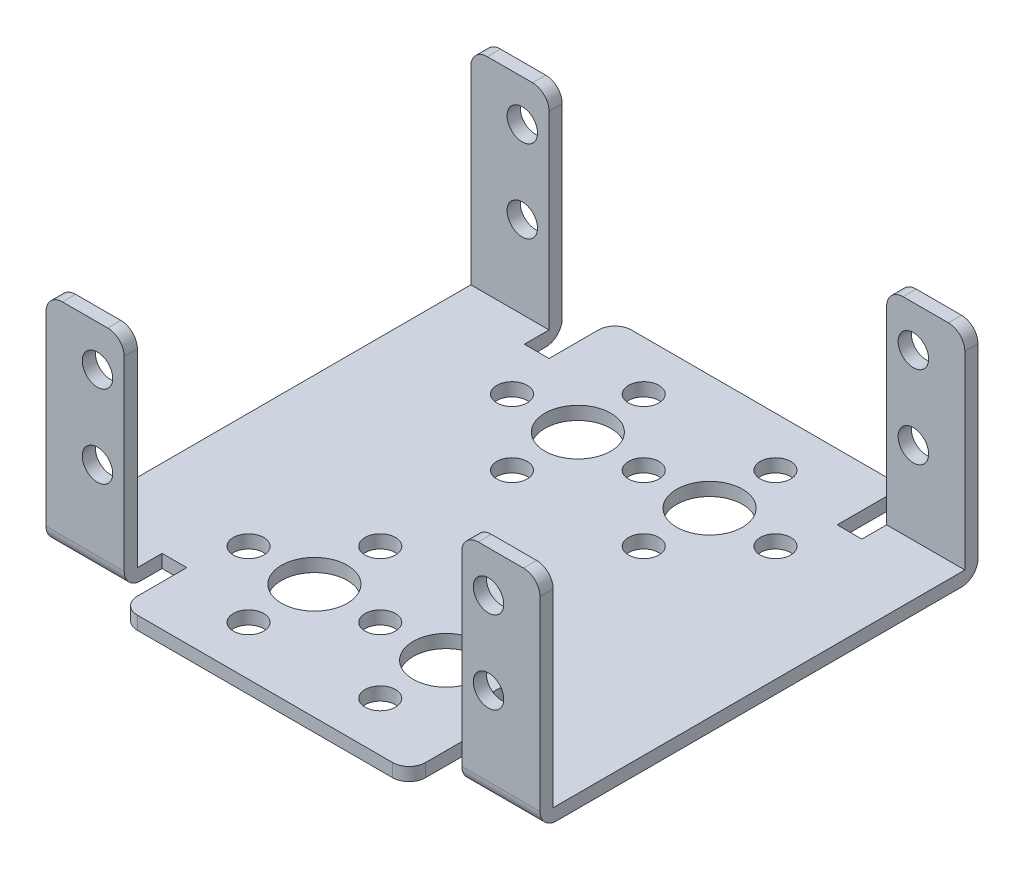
ISO-10303-21;
HEADER;
FILE_DESCRIPTION(('STEP AP214'),'2;1');
FILE_NAME('part.step','',(''),(''),'','','');
FILE_SCHEMA(('AUTOMOTIVE_DESIGN { 1 0 10303 214 1 1 1 1 }'));
ENDSEC;
DATA;
#1=APPLICATION_CONTEXT('core data for automotive mechanical design processes');
#2=APPLICATION_PROTOCOL_DEFINITION('international standard','automotive_design',2000,#1);
#3=PRODUCT_CONTEXT('',#1,'mechanical');
#4=PRODUCT('Part','Part','',(#3));
#5=PRODUCT_RELATED_PRODUCT_CATEGORY('part','',(#4));
#6=PRODUCT_DEFINITION_FORMATION('','',#4);
#7=PRODUCT_DEFINITION_CONTEXT('part definition',#1,'design');
#8=PRODUCT_DEFINITION('design','',#6,#7);
#9=PRODUCT_DEFINITION_SHAPE('','',#8);
#10=(LENGTH_UNIT() NAMED_UNIT(*) SI_UNIT(.MILLI.,.METRE.));
#11=(NAMED_UNIT(*) PLANE_ANGLE_UNIT() SI_UNIT($,.RADIAN.));
#12=(NAMED_UNIT(*) SI_UNIT($,.STERADIAN.) SOLID_ANGLE_UNIT());
#13=UNCERTAINTY_MEASURE_WITH_UNIT(LENGTH_MEASURE(1.E-05),#10,'distance_accuracy_value','');
#14=(GEOMETRIC_REPRESENTATION_CONTEXT(3) GLOBAL_UNCERTAINTY_ASSIGNED_CONTEXT((#13)) GLOBAL_UNIT_ASSIGNED_CONTEXT((#10,
#11,#12)) REPRESENTATION_CONTEXT('',''));
#15=CARTESIAN_POINT('',(0.,0.,0.));
#16=DIRECTION('',(0.,0.,1.));
#17=DIRECTION('',(1.,0.,0.));
#18=AXIS2_PLACEMENT_3D('',#15,#16,#17);
#19=CARTESIAN_POINT('',(0.,1.6,0.));
#20=DIRECTION('',(0.,-1.,0.));
#21=DIRECTION('',(0.,0.,-1.));
#22=AXIS2_PLACEMENT_3D('',#19,#20,#21);
#23=PLANE('',#22);
#24=CARTESIAN_POINT('',(38.,1.6,-50.6));
#25=DIRECTION('',(0.,1.,0.));
#26=DIRECTION('',(0.,0.,1.));
#27=AXIS2_PLACEMENT_3D('',#24,#25,#26);
#28=CIRCLE('',#27,1.85);
#29=CARTESIAN_POINT('',(38.,1.6,-48.75));
#30=VERTEX_POINT('',#29);
#31=EDGE_CURVE('E1518',#30,#30,#28,.T.);
#32=ORIENTED_EDGE('',*,*,#31,.F.);
#33=EDGE_LOOP('',(#32));
#34=FACE_BOUND('',#33,.T.);
#35=CARTESIAN_POINT('',(38.,1.6,-34.6));
#36=DIRECTION('',(0.,1.,0.));
#37=DIRECTION('',(0.,0.,1.));
#38=AXIS2_PLACEMENT_3D('',#35,#36,#37);
#39=CIRCLE('',#38,1.85);
#40=CARTESIAN_POINT('',(38.,1.6,-32.75));
#41=VERTEX_POINT('',#40);
#42=EDGE_CURVE('E1514',#41,#41,#39,.T.);
#43=ORIENTED_EDGE('',*,*,#42,.F.);
#44=EDGE_LOOP('',(#43));
#45=FACE_BOUND('',#44,.T.);
#46=CARTESIAN_POINT('',(46.,1.6,-42.6));
#47=DIRECTION('',(0.,1.,0.));
#48=DIRECTION('',(0.,0.,1.));
#49=AXIS2_PLACEMENT_3D('',#46,#47,#48);
#50=CIRCLE('',#49,1.85);
#51=CARTESIAN_POINT('',(46.,1.6,-40.75));
#52=VERTEX_POINT('',#51);
#53=EDGE_CURVE('E1510',#52,#52,#50,.T.);
#54=ORIENTED_EDGE('',*,*,#53,.F.);
#55=EDGE_LOOP('',(#54));
#56=FACE_BOUND('',#55,.T.);
#57=CARTESIAN_POINT('',(38.,1.6,-42.6));
#58=DIRECTION('',(0.,1.,0.));
#59=DIRECTION('',(0.,0.,1.));
#60=AXIS2_PLACEMENT_3D('',#57,#58,#59);
#61=CIRCLE('',#60,4.);
#62=CARTESIAN_POINT('',(38.,1.6,-38.6));
#63=VERTEX_POINT('',#62);
#64=EDGE_CURVE('E1506',#63,#63,#61,.T.);
#65=ORIENTED_EDGE('',*,*,#64,.F.);
#66=EDGE_LOOP('',(#65));
#67=FACE_BOUND('',#66,.T.);
#68=CARTESIAN_POINT('',(38.,1.6,-18.6));
#69=DIRECTION('',(0.,1.,0.));
#70=DIRECTION('',(0.,0.,1.));
#71=AXIS2_PLACEMENT_3D('',#68,#69,#70);
#72=CIRCLE('',#71,1.85);
#73=CARTESIAN_POINT('',(38.,1.6,-16.75));
#74=VERTEX_POINT('',#73);
#75=EDGE_CURVE('E1502',#74,#74,#72,.T.);
#76=ORIENTED_EDGE('',*,*,#75,.F.);
#77=EDGE_LOOP('',(#76));
#78=FACE_BOUND('',#77,.T.);
#79=CARTESIAN_POINT('',(38.,1.6,-2.6));
#80=DIRECTION('',(0.,1.,0.));
#81=DIRECTION('',(0.,0.,1.));
#82=AXIS2_PLACEMENT_3D('',#79,#80,#81);
#83=CIRCLE('',#82,1.85);
#84=CARTESIAN_POINT('',(38.,1.6,-0.750000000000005));
#85=VERTEX_POINT('',#84);
#86=EDGE_CURVE('E1498',#85,#85,#83,.T.);
#87=ORIENTED_EDGE('',*,*,#86,.F.);
#88=EDGE_LOOP('',(#87));
#89=FACE_BOUND('',#88,.T.);
#90=CARTESIAN_POINT('',(46.,1.6,-10.6));
#91=DIRECTION('',(0.,1.,0.));
#92=DIRECTION('',(0.,0.,1.));
#93=AXIS2_PLACEMENT_3D('',#90,#91,#92);
#94=CIRCLE('',#93,1.85);
#95=CARTESIAN_POINT('',(46.,1.6,-8.75));
#96=VERTEX_POINT('',#95);
#97=EDGE_CURVE('E1494',#96,#96,#94,.T.);
#98=ORIENTED_EDGE('',*,*,#97,.F.);
#99=EDGE_LOOP('',(#98));
#100=FACE_BOUND('',#99,.T.);
#101=CARTESIAN_POINT('',(38.,1.6,-10.6));
#102=DIRECTION('',(0.,1.,0.));
#103=DIRECTION('',(0.,0.,1.));
#104=AXIS2_PLACEMENT_3D('',#101,#102,#103);
#105=CIRCLE('',#104,4.);
#106=CARTESIAN_POINT('',(38.,1.6,-6.6));
#107=VERTEX_POINT('',#106);
#108=EDGE_CURVE('E1490',#107,#107,#105,.T.);
#109=ORIENTED_EDGE('',*,*,#108,.F.);
#110=EDGE_LOOP('',(#109));
#111=FACE_BOUND('',#110,.T.);
#112=CARTESIAN_POINT('',(22.,1.6,-18.6));
#113=DIRECTION('',(0.,1.,0.));
#114=DIRECTION('',(0.,0.,1.));
#115=AXIS2_PLACEMENT_3D('',#112,#113,#114);
#116=CIRCLE('',#115,1.85);
#117=CARTESIAN_POINT('',(22.,1.6,-16.75));
#118=VERTEX_POINT('',#117);
#119=EDGE_CURVE('E1486',#118,#118,#116,.T.);
#120=ORIENTED_EDGE('',*,*,#119,.F.);
#121=EDGE_LOOP('',(#120));
#122=FACE_BOUND('',#121,.T.);
#123=CARTESIAN_POINT('',(22.,1.6,-2.6));
#124=DIRECTION('',(0.,1.,0.));
#125=DIRECTION('',(0.,0.,1.));
#126=AXIS2_PLACEMENT_3D('',#123,#124,#125);
#127=CIRCLE('',#126,1.85);
#128=CARTESIAN_POINT('',(22.,1.6,-0.750000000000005));
#129=VERTEX_POINT('',#128);
#130=EDGE_CURVE('E1482',#129,#129,#127,.T.);
#131=ORIENTED_EDGE('',*,*,#130,.F.);
#132=EDGE_LOOP('',(#131));
#133=FACE_BOUND('',#132,.T.);
#134=CARTESIAN_POINT('',(30.,1.6,-10.6));
#135=DIRECTION('',(0.,1.,0.));
#136=DIRECTION('',(0.,0.,1.));
#137=AXIS2_PLACEMENT_3D('',#134,#135,#136);
#138=CIRCLE('',#137,1.85);
#139=CARTESIAN_POINT('',(30.,1.6,-8.75));
#140=VERTEX_POINT('',#139);
#141=EDGE_CURVE('E1478',#140,#140,#138,.T.);
#142=ORIENTED_EDGE('',*,*,#141,.F.);
#143=EDGE_LOOP('',(#142));
#144=FACE_BOUND('',#143,.T.);
#145=CARTESIAN_POINT('',(22.,1.6,-10.6));
#146=DIRECTION('',(0.,1.,0.));
#147=DIRECTION('',(0.,0.,1.));
#148=AXIS2_PLACEMENT_3D('',#145,#146,#147);
#149=CIRCLE('',#148,4.);
#150=CARTESIAN_POINT('',(22.,1.6,-6.6));
#151=VERTEX_POINT('',#150);
#152=EDGE_CURVE('E1474',#151,#151,#149,.T.);
#153=ORIENTED_EDGE('',*,*,#152,.F.);
#154=EDGE_LOOP('',(#153));
#155=FACE_BOUND('',#154,.T.);
#156=CARTESIAN_POINT('',(22.,1.6,-50.6));
#157=DIRECTION('',(0.,1.,0.));
#158=DIRECTION('',(0.,0.,1.));
#159=AXIS2_PLACEMENT_3D('',#156,#157,#158);
#160=CIRCLE('',#159,1.85);
#161=CARTESIAN_POINT('',(22.,1.6,-48.75));
#162=VERTEX_POINT('',#161);
#163=EDGE_CURVE('E1470',#162,#162,#160,.T.);
#164=ORIENTED_EDGE('',*,*,#163,.F.);
#165=EDGE_LOOP('',(#164));
#166=FACE_BOUND('',#165,.T.);
#167=CARTESIAN_POINT('',(22.,1.6,-34.6));
#168=DIRECTION('',(0.,1.,0.));
#169=DIRECTION('',(0.,0.,1.));
#170=AXIS2_PLACEMENT_3D('',#167,#168,#169);
#171=CIRCLE('',#170,1.85);
#172=CARTESIAN_POINT('',(22.,1.6,-32.75));
#173=VERTEX_POINT('',#172);
#174=EDGE_CURVE('E1466',#173,#173,#171,.T.);
#175=ORIENTED_EDGE('',*,*,#174,.F.);
#176=EDGE_LOOP('',(#175));
#177=FACE_BOUND('',#176,.T.);
#178=CARTESIAN_POINT('',(30.,1.6,-42.6));
#179=DIRECTION('',(0.,1.,0.));
#180=DIRECTION('',(0.,0.,1.));
#181=AXIS2_PLACEMENT_3D('',#178,#179,#180);
#182=CIRCLE('',#181,1.85);
#183=CARTESIAN_POINT('',(30.,1.6,-40.75));
#184=VERTEX_POINT('',#183);
#185=EDGE_CURVE('E1462',#184,#184,#182,.T.);
#186=ORIENTED_EDGE('',*,*,#185,.F.);
#187=EDGE_LOOP('',(#186));
#188=FACE_BOUND('',#187,.T.);
#189=CARTESIAN_POINT('',(22.,1.6,-42.6));
#190=DIRECTION('',(0.,1.,0.));
#191=DIRECTION('',(0.,0.,1.));
#192=AXIS2_PLACEMENT_3D('',#189,#190,#191);
#193=CIRCLE('',#192,4.);
#194=CARTESIAN_POINT('',(22.,1.6,-38.6));
#195=VERTEX_POINT('',#194);
#196=EDGE_CURVE('E1458',#195,#195,#193,.T.);
#197=ORIENTED_EDGE('',*,*,#196,.F.);
#198=EDGE_LOOP('',(#197));
#199=FACE_BOUND('',#198,.T.);
#200=CARTESIAN_POINT('',(14.,1.6,-42.6));
#201=DIRECTION('',(0.,1.,0.));
#202=DIRECTION('',(0.,0.,1.));
#203=AXIS2_PLACEMENT_3D('',#200,#201,#202);
#204=CIRCLE('',#203,1.85);
#205=CARTESIAN_POINT('',(14.,1.6,-40.75));
#206=VERTEX_POINT('',#205);
#207=EDGE_CURVE('E1454',#206,#206,#204,.T.);
#208=ORIENTED_EDGE('',*,*,#207,.F.);
#209=EDGE_LOOP('',(#208));
#210=FACE_BOUND('',#209,.T.);
#211=CARTESIAN_POINT('',(14.,1.6,-10.6));
#212=DIRECTION('',(0.,1.,0.));
#213=DIRECTION('',(0.,0.,1.));
#214=AXIS2_PLACEMENT_3D('',#211,#212,#213);
#215=CIRCLE('',#214,1.85);
#216=CARTESIAN_POINT('',(14.,1.6,-8.75));
#217=VERTEX_POINT('',#216);
#218=EDGE_CURVE('E1450',#217,#217,#215,.T.);
#219=ORIENTED_EDGE('',*,*,#218,.F.);
#220=EDGE_LOOP('',(#219));
#221=FACE_BOUND('',#220,.T.);
#222=DIRECTION('',(0.,0.,-1.));
#223=VECTOR('',#222,1.);
#224=CARTESIAN_POINT('',(47.5,1.6,-56.6));
#225=LINE('',#224,#223);
#226=CARTESIAN_POINT('',(47.5,1.6,-48.6));
#227=VERTEX_POINT('',#226);
#228=CARTESIAN_POINT('',(47.5,1.6,-54.6));
#229=VERTEX_POINT('',#228);
#230=EDGE_CURVE('E1546',#227,#229,#225,.T.);
#231=ORIENTED_EDGE('',*,*,#230,.T.);
#232=CARTESIAN_POINT('',(45.5,1.6,-54.6));
#233=DIRECTION('',(0.,-1.,0.));
#234=DIRECTION('',(0.,0.,-1.));
#235=AXIS2_PLACEMENT_3D('',#232,#233,#234);
#236=CIRCLE('',#235,2.);
#237=CARTESIAN_POINT('',(45.5,1.6,-56.6));
#238=VERTEX_POINT('',#237);
#239=EDGE_CURVE('E477',#229,#238,#236,.F.);
#240=ORIENTED_EDGE('',*,*,#239,.T.);
#241=DIRECTION('',(-1.,0.,0.));
#242=VECTOR('',#241,1.);
#243=CARTESIAN_POINT('',(12.5,1.6,-56.6));
#244=LINE('',#243,#242);
#245=CARTESIAN_POINT('',(14.5,1.6,-56.6));
#246=VERTEX_POINT('',#245);
#247=EDGE_CURVE('E1548',#238,#246,#244,.T.);
#248=ORIENTED_EDGE('',*,*,#247,.T.);
#249=CARTESIAN_POINT('',(14.5,1.6,-54.6));
#250=DIRECTION('',(0.,-1.,0.));
#251=DIRECTION('',(0.,0.,-1.));
#252=AXIS2_PLACEMENT_3D('',#249,#250,#251);
#253=CIRCLE('',#252,2.);
#254=CARTESIAN_POINT('',(12.5,1.6,-54.6));
#255=VERTEX_POINT('',#254);
#256=EDGE_CURVE('E468',#246,#255,#253,.F.);
#257=ORIENTED_EDGE('',*,*,#256,.T.);
#258=DIRECTION('',(0.,0.,1.));
#259=VECTOR('',#258,1.);
#260=CARTESIAN_POINT('',(12.5,1.6,-48.6));
#261=LINE('',#260,#259);
#262=CARTESIAN_POINT('',(12.5,1.6,-48.6));
#263=VERTEX_POINT('',#262);
#264=EDGE_CURVE('E679',#255,#263,#261,.T.);
#265=ORIENTED_EDGE('',*,*,#264,.T.);
#266=DIRECTION('',(-1.,0.,0.));
#267=VECTOR('',#266,1.);
#268=CARTESIAN_POINT('',(9.5,1.6,-48.6));
#269=LINE('',#268,#267);
#270=CARTESIAN_POINT('',(9.5,1.6,-48.6));
#271=VERTEX_POINT('',#270);
#272=EDGE_CURVE('E564',#263,#271,#269,.T.);
#273=ORIENTED_EDGE('',*,*,#272,.T.);
#274=DIRECTION('',(0.,0.,-1.));
#275=VECTOR('',#274,1.);
#276=CARTESIAN_POINT('',(9.5,1.6,-53.2));
#277=LINE('',#276,#275);
#278=CARTESIAN_POINT('',(9.5,1.6,-51.6));
#279=VERTEX_POINT('',#278);
#280=EDGE_CURVE('E561',#271,#279,#277,.T.);
#281=ORIENTED_EDGE('',*,*,#280,.T.);
#282=DIRECTION('',(1.,0.,0.));
#283=VECTOR('',#282,1.);
#284=CARTESIAN_POINT('',(0.,1.6,-51.6));
#285=LINE('',#284,#283);
#286=CARTESIAN_POINT('',(0.,1.6,-51.6));
#287=VERTEX_POINT('',#286);
#288=EDGE_CURVE('E358',#287,#279,#285,.T.);
#289=ORIENTED_EDGE('',*,*,#288,.F.);
#290=DIRECTION('',(0.,0.,1.));
#291=VECTOR('',#290,1.);
#292=CARTESIAN_POINT('',(0.,1.6,0.));
#293=LINE('',#292,#291);
#294=CARTESIAN_POINT('',(0.,1.6,-1.6));
#295=VERTEX_POINT('',#294);
#296=EDGE_CURVE('E373',#287,#295,#293,.T.);
#297=ORIENTED_EDGE('',*,*,#296,.T.);
#298=DIRECTION('',(-1.,0.,0.));
#299=VECTOR('',#298,1.);
#300=CARTESIAN_POINT('',(0.,1.6,-1.6));
#301=LINE('',#300,#299);
#302=CARTESIAN_POINT('',(9.49999999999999,1.6,-1.6));
#303=VERTEX_POINT('',#302);
#304=EDGE_CURVE('E1570',#303,#295,#301,.T.);
#305=ORIENTED_EDGE('',*,*,#304,.F.);
#306=DIRECTION('',(0.,0.,-1.));
#307=VECTOR('',#306,1.);
#308=CARTESIAN_POINT('',(9.49999999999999,1.6,-4.6));
#309=LINE('',#308,#307);
#310=CARTESIAN_POINT('',(9.49999999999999,1.6,-4.6));
#311=VERTEX_POINT('',#310);
#312=EDGE_CURVE('E367',#303,#311,#309,.T.);
#313=ORIENTED_EDGE('',*,*,#312,.T.);
#314=DIRECTION('',(1.,0.,0.));
#315=VECTOR('',#314,1.);
#316=CARTESIAN_POINT('',(12.5,1.6,-4.6));
#317=LINE('',#316,#315);
#318=CARTESIAN_POINT('',(12.5,1.6,-4.6));
#319=VERTEX_POINT('',#318);
#320=EDGE_CURVE('E1563',#311,#319,#317,.T.);
#321=ORIENTED_EDGE('',*,*,#320,.T.);
#322=DIRECTION('',(0.,0.,1.));
#323=VECTOR('',#322,1.);
#324=CARTESIAN_POINT('',(12.5,1.6,3.40000000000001));
#325=LINE('',#324,#323);
#326=CARTESIAN_POINT('',(12.5,1.6,1.40000000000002));
#327=VERTEX_POINT('',#326);
#328=EDGE_CURVE('E1561',#319,#327,#325,.T.);
#329=ORIENTED_EDGE('',*,*,#328,.T.);
#330=CARTESIAN_POINT('',(14.5,1.6,1.40000000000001));
#331=DIRECTION('',(0.,-1.,0.));
#332=DIRECTION('',(0.,0.,-1.));
#333=AXIS2_PLACEMENT_3D('',#330,#331,#332);
#334=CIRCLE('',#333,2.);
#335=CARTESIAN_POINT('',(14.5,1.6,3.40000000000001));
#336=VERTEX_POINT('',#335);
#337=EDGE_CURVE('E419',#327,#336,#334,.F.);
#338=ORIENTED_EDGE('',*,*,#337,.T.);
#339=DIRECTION('',(1.,0.,0.));
#340=VECTOR('',#339,1.);
#341=CARTESIAN_POINT('',(47.5,1.6,3.40000000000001));
#342=LINE('',#341,#340);
#343=CARTESIAN_POINT('',(45.5,1.6,3.40000000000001));
#344=VERTEX_POINT('',#343);
#345=EDGE_CURVE('E1559',#336,#344,#342,.T.);
#346=ORIENTED_EDGE('',*,*,#345,.T.);
#347=CARTESIAN_POINT('',(45.5,1.6,1.40000000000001));
#348=DIRECTION('',(0.,-1.,0.));
#349=DIRECTION('',(0.,0.,-1.));
#350=AXIS2_PLACEMENT_3D('',#347,#348,#349);
#351=CIRCLE('',#350,2.);
#352=CARTESIAN_POINT('',(47.5,1.6,1.40000000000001));
#353=VERTEX_POINT('',#352);
#354=EDGE_CURVE('E410',#344,#353,#351,.F.);
#355=ORIENTED_EDGE('',*,*,#354,.T.);
#356=DIRECTION('',(0.,0.,-1.));
#357=VECTOR('',#356,1.);
#358=CARTESIAN_POINT('',(47.5,1.6,-4.6));
#359=LINE('',#358,#357);
#360=CARTESIAN_POINT('',(47.5,1.6,-4.6));
#361=VERTEX_POINT('',#360);
#362=EDGE_CURVE('E1541',#353,#361,#359,.T.);
#363=ORIENTED_EDGE('',*,*,#362,.T.);
#364=DIRECTION('',(1.,0.,0.));
#365=VECTOR('',#364,1.);
#366=CARTESIAN_POINT('',(50.5,1.6,-4.6));
#367=LINE('',#366,#365);
#368=CARTESIAN_POINT('',(50.5,1.6,-4.6));
#369=VERTEX_POINT('',#368);
#370=EDGE_CURVE('E1539',#361,#369,#367,.T.);
#371=ORIENTED_EDGE('',*,*,#370,.T.);
#372=DIRECTION('',(0.,0.,1.));
#373=VECTOR('',#372,1.);
#374=CARTESIAN_POINT('',(50.5,1.6,0.));
#375=LINE('',#374,#373);
#376=CARTESIAN_POINT('',(50.5,1.6,-1.6));
#377=VERTEX_POINT('',#376);
#378=EDGE_CURVE('E333',#369,#377,#375,.T.);
#379=ORIENTED_EDGE('',*,*,#378,.T.);
#380=DIRECTION('',(-1.,0.,0.));
#381=VECTOR('',#380,1.);
#382=CARTESIAN_POINT('',(60.,1.6,-1.6));
#383=LINE('',#382,#381);
#384=CARTESIAN_POINT('',(60.,1.6,-1.6));
#385=VERTEX_POINT('',#384);
#386=EDGE_CURVE('E317',#385,#377,#383,.T.);
#387=ORIENTED_EDGE('',*,*,#386,.F.);
#388=DIRECTION('',(0.,0.,-1.));
#389=VECTOR('',#388,1.);
#390=CARTESIAN_POINT('',(60.,1.6,-53.2));
#391=LINE('',#390,#389);
#392=CARTESIAN_POINT('',(60.,1.6,-51.6));
#393=VERTEX_POINT('',#392);
#394=EDGE_CURVE('E325',#385,#393,#391,.T.);
#395=ORIENTED_EDGE('',*,*,#394,.T.);
#396=DIRECTION('',(1.,0.,0.));
#397=VECTOR('',#396,1.);
#398=CARTESIAN_POINT('',(60.,1.6,-51.6));
#399=LINE('',#398,#397);
#400=CARTESIAN_POINT('',(50.5,1.6,-51.6));
#401=VERTEX_POINT('',#400);
#402=EDGE_CURVE('E321',#401,#393,#399,.T.);
#403=ORIENTED_EDGE('',*,*,#402,.F.);
#404=DIRECTION('',(0.,0.,1.));
#405=VECTOR('',#404,1.);
#406=CARTESIAN_POINT('',(50.5,1.6,-48.6));
#407=LINE('',#406,#405);
#408=CARTESIAN_POINT('',(50.5,1.6,-48.6));
#409=VERTEX_POINT('',#408);
#410=EDGE_CURVE('E332',#401,#409,#407,.T.);
#411=ORIENTED_EDGE('',*,*,#410,.T.);
#412=DIRECTION('',(-1.,0.,0.));
#413=VECTOR('',#412,1.);
#414=CARTESIAN_POINT('',(47.5,1.6,-48.6));
#415=LINE('',#414,#413);
#416=EDGE_CURVE('E622',#409,#227,#415,.T.);
#417=ORIENTED_EDGE('',*,*,#416,.T.);
#418=EDGE_LOOP('',(#231,#240,#248,#257,#265,#273,#281,#289,#297,#305,#313,#321,#329,#338,#346,
#355,#363,#371,#379,#387,#395,#403,#411,#417));
#419=FACE_BOUND('',#418,.T.);
#420=ADVANCED_FACE('F31',(#34,#45,#56,#67,#78,#89,#100,#111,#122,#133,#144,#155,#166,#177,#188,
#199,#210,#221,#419),#23,.F.);
#421=CARTESIAN_POINT('',(9.49999999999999,1.6,0.));
#422=DIRECTION('',(0.,0.,-1.));
#423=DIRECTION('',(-1.,0.,0.));
#424=AXIS2_PLACEMENT_3D('',#421,#422,#423);
#425=PLANE('',#424);
#426=CARTESIAN_POINT('',(6.25,11.6,0.));
#427=DIRECTION('',(0.,0.,1.));
#428=DIRECTION('',(1.,0.,0.));
#429=AXIS2_PLACEMENT_3D('',#426,#427,#428);
#430=CIRCLE('',#429,1.85);
#431=CARTESIAN_POINT('',(8.1,11.6,0.));
#432=VERTEX_POINT('',#431);
#433=EDGE_CURVE('E1436',#432,#432,#430,.T.);
#434=ORIENTED_EDGE('',*,*,#433,.F.);
#435=EDGE_LOOP('',(#434));
#436=FACE_BOUND('',#435,.T.);
#437=CARTESIAN_POINT('',(6.25,21.6,0.));
#438=DIRECTION('',(0.,0.,1.));
#439=DIRECTION('',(1.,0.,0.));
#440=AXIS2_PLACEMENT_3D('',#437,#438,#439);
#441=CIRCLE('',#440,1.85);
#442=CARTESIAN_POINT('',(8.1,21.6,0.));
#443=VERTEX_POINT('',#442);
#444=EDGE_CURVE('E1420',#443,#443,#441,.T.);
#445=ORIENTED_EDGE('',*,*,#444,.F.);
#446=EDGE_LOOP('',(#445));
#447=FACE_BOUND('',#446,.T.);
#448=DIRECTION('',(0.,-1.,0.));
#449=VECTOR('',#448,1.);
#450=CARTESIAN_POINT('',(0.,1.6,0.));
#451=LINE('',#450,#449);
#452=CARTESIAN_POINT('',(0.,24.6,0.));
#453=VERTEX_POINT('',#452);
#454=CARTESIAN_POINT('',(0.,2.,0.));
#455=VERTEX_POINT('',#454);
#456=EDGE_CURVE('E601',#453,#455,#451,.T.);
#457=ORIENTED_EDGE('',*,*,#456,.T.);
#458=DIRECTION('',(1.,0.,0.));
#459=VECTOR('',#458,1.);
#460=CARTESIAN_POINT('',(9.49999999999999,2.,0.));
#461=LINE('',#460,#459);
#462=CARTESIAN_POINT('',(9.49999999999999,2.,0.));
#463=VERTEX_POINT('',#462);
#464=EDGE_CURVE('E479',#455,#463,#461,.T.);
#465=ORIENTED_EDGE('',*,*,#464,.T.);
#466=DIRECTION('',(0.,-1.,0.));
#467=VECTOR('',#466,1.);
#468=CARTESIAN_POINT('',(9.49999999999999,1.6,0.));
#469=LINE('',#468,#467);
#470=CARTESIAN_POINT('',(9.49999999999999,24.6,0.));
#471=VERTEX_POINT('',#470);
#472=EDGE_CURVE('E558',#471,#463,#469,.T.);
#473=ORIENTED_EDGE('',*,*,#472,.F.);
#474=CARTESIAN_POINT('',(7.49999999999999,24.6,0.));
#475=DIRECTION('',(0.,0.,-1.));
#476=DIRECTION('',(-1.,0.,0.));
#477=AXIS2_PLACEMENT_3D('',#474,#475,#476);
#478=CIRCLE('',#477,2.);
#479=CARTESIAN_POINT('',(7.49999999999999,26.6,0.));
#480=VERTEX_POINT('',#479);
#481=EDGE_CURVE('E398',#471,#480,#478,.F.);
#482=ORIENTED_EDGE('',*,*,#481,.T.);
#483=DIRECTION('',(1.,0.,0.));
#484=VECTOR('',#483,1.);
#485=CARTESIAN_POINT('',(0.,26.6,0.));
#486=LINE('',#485,#484);
#487=CARTESIAN_POINT('',(2.,26.6,0.));
#488=VERTEX_POINT('',#487);
#489=EDGE_CURVE('E1593',#488,#480,#486,.T.);
#490=ORIENTED_EDGE('',*,*,#489,.F.);
#491=CARTESIAN_POINT('',(2.,24.6,0.));
#492=DIRECTION('',(0.,0.,-1.));
#493=DIRECTION('',(-1.,0.,0.));
#494=AXIS2_PLACEMENT_3D('',#491,#492,#493);
#495=CIRCLE('',#494,2.);
#496=EDGE_CURVE('E433',#488,#453,#495,.F.);
#497=ORIENTED_EDGE('',*,*,#496,.T.);
#498=EDGE_LOOP('',(#457,#465,#473,#482,#490,#497));
#499=FACE_BOUND('',#498,.T.);
#500=ADVANCED_FACE('F710',(#436,#447,#499),#425,.F.);
#501=CARTESIAN_POINT('',(9.49999999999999,1.6,-4.6));
#502=DIRECTION('',(-1.,0.,0.));
#503=DIRECTION('',(0.,0.,1.));
#504=AXIS2_PLACEMENT_3D('',#501,#502,#503);
#505=PLANE('',#504);
#506=ORIENTED_EDGE('',*,*,#472,.T.);
#507=CARTESIAN_POINT('',(9.49999999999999,2.,-2.));
#508=DIRECTION('',(-1.,0.,0.));
#509=DIRECTION('',(0.,0.,1.));
#510=AXIS2_PLACEMENT_3D('',#507,#508,#509);
#511=CIRCLE('',#510,2.);
#512=CARTESIAN_POINT('',(9.49999999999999,0.,-2.));
#513=VERTEX_POINT('',#512);
#514=EDGE_CURVE('E482',#463,#513,#511,.F.);
#515=ORIENTED_EDGE('',*,*,#514,.T.);
#516=DIRECTION('',(0.,0.,-1.));
#517=VECTOR('',#516,1.);
#518=CARTESIAN_POINT('',(9.49999999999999,0.,-4.6));
#519=LINE('',#518,#517);
#520=CARTESIAN_POINT('',(9.49999999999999,0.,-4.6));
#521=VERTEX_POINT('',#520);
#522=EDGE_CURVE('E437',#513,#521,#519,.T.);
#523=ORIENTED_EDGE('',*,*,#522,.T.);
#524=DIRECTION('',(0.,-1.,0.));
#525=VECTOR('',#524,1.);
#526=CARTESIAN_POINT('',(9.49999999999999,1.6,-4.6));
#527=LINE('',#526,#525);
#528=EDGE_CURVE('E555',#311,#521,#527,.T.);
#529=ORIENTED_EDGE('',*,*,#528,.F.);
#530=ORIENTED_EDGE('',*,*,#312,.F.);
#531=DIRECTION('',(0.,-1.,0.));
#532=VECTOR('',#531,1.);
#533=CARTESIAN_POINT('',(9.49999999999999,26.6,-1.6));
#534=LINE('',#533,#532);
#535=CARTESIAN_POINT('',(9.49999999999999,24.6,-1.6));
#536=VERTEX_POINT('',#535);
#537=EDGE_CURVE('E339',#536,#303,#534,.T.);
#538=ORIENTED_EDGE('',*,*,#537,.F.);
#539=DIRECTION('',(0.,0.,-1.));
#540=VECTOR('',#539,1.);
#541=CARTESIAN_POINT('',(9.49999999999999,24.6,0.));
#542=LINE('',#541,#540);
#543=EDGE_CURVE('E396',#536,#471,#542,.F.);
#544=ORIENTED_EDGE('',*,*,#543,.T.);
#545=EDGE_LOOP('',(#506,#515,#523,#529,#530,#538,#544));
#546=FACE_BOUND('',#545,.T.);
#547=ADVANCED_FACE('F716',(#546),#505,.F.);
#548=CARTESIAN_POINT('',(12.5,1.6,-4.6));
#549=DIRECTION('',(0.,0.,-1.));
#550=DIRECTION('',(-1.,0.,0.));
#551=AXIS2_PLACEMENT_3D('',#548,#549,#550);
#552=PLANE('',#551);
#553=DIRECTION('',(1.,0.,0.));
#554=VECTOR('',#553,1.);
#555=CARTESIAN_POINT('',(12.5,0.,-4.6));
#556=LINE('',#555,#554);
#557=CARTESIAN_POINT('',(12.5,0.,-4.6));
#558=VERTEX_POINT('',#557);
#559=EDGE_CURVE('E571',#521,#558,#556,.T.);
#560=ORIENTED_EDGE('',*,*,#559,.T.);
#561=DIRECTION('',(0.,-1.,0.));
#562=VECTOR('',#561,1.);
#563=CARTESIAN_POINT('',(12.5,1.6,-4.6));
#564=LINE('',#563,#562);
#565=EDGE_CURVE('E552',#319,#558,#564,.T.);
#566=ORIENTED_EDGE('',*,*,#565,.F.);
#567=ORIENTED_EDGE('',*,*,#320,.F.);
#568=ORIENTED_EDGE('',*,*,#528,.T.);
#569=EDGE_LOOP('',(#560,#566,#567,#568));
#570=FACE_BOUND('',#569,.T.);
#571=ADVANCED_FACE('F778',(#570),#552,.F.);
#572=CARTESIAN_POINT('',(12.5,1.6,3.40000000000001));
#573=DIRECTION('',(1.,0.,0.));
#574=DIRECTION('',(0.,0.,-1.));
#575=AXIS2_PLACEMENT_3D('',#572,#573,#574);
#576=PLANE('',#575);
#577=DIRECTION('',(0.,0.,1.));
#578=VECTOR('',#577,1.);
#579=CARTESIAN_POINT('',(12.5,0.,3.40000000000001));
#580=LINE('',#579,#578);
#581=CARTESIAN_POINT('',(12.5,0.,1.40000000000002));
#582=VERTEX_POINT('',#581);
#583=EDGE_CURVE('E573',#558,#582,#580,.T.);
#584=ORIENTED_EDGE('',*,*,#583,.T.);
#585=DIRECTION('',(0.,-1.,0.));
#586=VECTOR('',#585,1.);
#587=CARTESIAN_POINT('',(12.5,1.6,1.40000000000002));
#588=LINE('',#587,#586);
#589=EDGE_CURVE('E417',#582,#327,#588,.F.);
#590=ORIENTED_EDGE('',*,*,#589,.T.);
#591=ORIENTED_EDGE('',*,*,#328,.F.);
#592=ORIENTED_EDGE('',*,*,#565,.T.);
#593=EDGE_LOOP('',(#584,#590,#591,#592));
#594=FACE_BOUND('',#593,.T.);
#595=ADVANCED_FACE('F774',(#594),#576,.F.);
#596=CARTESIAN_POINT('',(47.5,1.6,3.40000000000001));
#597=DIRECTION('',(0.,0.,-1.));
#598=DIRECTION('',(-1.,0.,0.));
#599=AXIS2_PLACEMENT_3D('',#596,#597,#598);
#600=PLANE('',#599);
#601=ORIENTED_EDGE('',*,*,#345,.F.);
#602=DIRECTION('',(0.,-1.,0.));
#603=VECTOR('',#602,1.);
#604=CARTESIAN_POINT('',(14.5,1.6,3.40000000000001));
#605=LINE('',#604,#603);
#606=CARTESIAN_POINT('',(14.5,0.,3.40000000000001));
#607=VERTEX_POINT('',#606);
#608=EDGE_CURVE('E412',#336,#607,#605,.T.);
#609=ORIENTED_EDGE('',*,*,#608,.T.);
#610=DIRECTION('',(1.,0.,0.));
#611=VECTOR('',#610,1.);
#612=CARTESIAN_POINT('',(47.5,0.,3.40000000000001));
#613=LINE('',#612,#611);
#614=CARTESIAN_POINT('',(45.5,0.,3.40000000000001));
#615=VERTEX_POINT('',#614);
#616=EDGE_CURVE('E576',#607,#615,#613,.T.);
#617=ORIENTED_EDGE('',*,*,#616,.T.);
#618=DIRECTION('',(0.,-1.,0.));
#619=VECTOR('',#618,1.);
#620=CARTESIAN_POINT('',(45.5,1.6,3.40000000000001));
#621=LINE('',#620,#619);
#622=EDGE_CURVE('E407',#615,#344,#621,.F.);
#623=ORIENTED_EDGE('',*,*,#622,.T.);
#624=EDGE_LOOP('',(#601,#609,#617,#623));
#625=FACE_BOUND('',#624,.T.);
#626=ADVANCED_FACE('F770',(#625),#600,.F.);
#627=CARTESIAN_POINT('',(47.5,1.6,-4.6));
#628=DIRECTION('',(-1.,0.,0.));
#629=DIRECTION('',(0.,0.,1.));
#630=AXIS2_PLACEMENT_3D('',#627,#628,#629);
#631=PLANE('',#630);
#632=ORIENTED_EDGE('',*,*,#362,.F.);
#633=DIRECTION('',(0.,-1.,0.));
#634=VECTOR('',#633,1.);
#635=CARTESIAN_POINT('',(47.5,1.6,1.40000000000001));
#636=LINE('',#635,#634);
#637=CARTESIAN_POINT('',(47.5,0.,1.40000000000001));
#638=VERTEX_POINT('',#637);
#639=EDGE_CURVE('E401',#353,#638,#636,.T.);
#640=ORIENTED_EDGE('',*,*,#639,.T.);
#641=DIRECTION('',(0.,0.,-1.));
#642=VECTOR('',#641,1.);
#643=CARTESIAN_POINT('',(47.5,0.,-4.6));
#644=LINE('',#643,#642);
#645=CARTESIAN_POINT('',(47.5,0.,-4.6));
#646=VERTEX_POINT('',#645);
#647=EDGE_CURVE('E578',#638,#646,#644,.T.);
#648=ORIENTED_EDGE('',*,*,#647,.T.);
#649=DIRECTION('',(0.,-1.,0.));
#650=VECTOR('',#649,1.);
#651=CARTESIAN_POINT('',(47.5,1.6,-4.6));
#652=LINE('',#651,#650);
#653=EDGE_CURVE('E549',#361,#646,#652,.T.);
#654=ORIENTED_EDGE('',*,*,#653,.F.);
#655=EDGE_LOOP('',(#632,#640,#648,#654));
#656=FACE_BOUND('',#655,.T.);
#657=ADVANCED_FACE('F766',(#656),#631,.F.);
#658=CARTESIAN_POINT('',(50.5,1.6,-4.6));
#659=DIRECTION('',(0.,0.,-1.));
#660=DIRECTION('',(-1.,0.,0.));
#661=AXIS2_PLACEMENT_3D('',#658,#659,#660);
#662=PLANE('',#661);
#663=DIRECTION('',(1.,0.,0.));
#664=VECTOR('',#663,1.);
#665=CARTESIAN_POINT('',(50.5,0.,-4.6));
#666=LINE('',#665,#664);
#667=CARTESIAN_POINT('',(50.5,0.,-4.6));
#668=VERTEX_POINT('',#667);
#669=EDGE_CURVE('E580',#646,#668,#666,.T.);
#670=ORIENTED_EDGE('',*,*,#669,.T.);
#671=DIRECTION('',(0.,-1.,0.));
#672=VECTOR('',#671,1.);
#673=CARTESIAN_POINT('',(50.5,1.6,-4.6));
#674=LINE('',#673,#672);
#675=EDGE_CURVE('E546',#369,#668,#674,.T.);
#676=ORIENTED_EDGE('',*,*,#675,.F.);
#677=ORIENTED_EDGE('',*,*,#370,.F.);
#678=ORIENTED_EDGE('',*,*,#653,.T.);
#679=EDGE_LOOP('',(#670,#676,#677,#678));
#680=FACE_BOUND('',#679,.T.);
#681=ADVANCED_FACE('F762',(#680),#662,.F.);
#682=CARTESIAN_POINT('',(50.5,1.6,0.));
#683=DIRECTION('',(1.,0.,0.));
#684=DIRECTION('',(0.,0.,-1.));
#685=AXIS2_PLACEMENT_3D('',#682,#683,#684);
#686=PLANE('',#685);
#687=DIRECTION('',(0.,0.,1.));
#688=VECTOR('',#687,1.);
#689=CARTESIAN_POINT('',(50.5,0.,0.));
#690=LINE('',#689,#688);
#691=CARTESIAN_POINT('',(50.5,0.,-2.));
#692=VERTEX_POINT('',#691);
#693=EDGE_CURVE('E582',#668,#692,#690,.T.);
#694=ORIENTED_EDGE('',*,*,#693,.T.);
#695=CARTESIAN_POINT('',(50.5,2.,-2.));
#696=DIRECTION('',(1.,0.,0.));
#697=DIRECTION('',(0.,0.,-1.));
#698=AXIS2_PLACEMENT_3D('',#695,#696,#697);
#699=CIRCLE('',#698,2.);
#700=CARTESIAN_POINT('',(50.5,2.,0.));
#701=VERTEX_POINT('',#700);
#702=EDGE_CURVE('E496',#692,#701,#699,.F.);
#703=ORIENTED_EDGE('',*,*,#702,.T.);
#704=DIRECTION('',(0.,-1.,0.));
#705=VECTOR('',#704,1.);
#706=CARTESIAN_POINT('',(50.5,1.6,0.));
#707=LINE('',#706,#705);
#708=CARTESIAN_POINT('',(50.5,24.6,0.));
#709=VERTEX_POINT('',#708);
#710=EDGE_CURVE('E538',#709,#701,#707,.T.);
#711=ORIENTED_EDGE('',*,*,#710,.F.);
#712=DIRECTION('',(0.,0.,1.));
#713=VECTOR('',#712,1.);
#714=CARTESIAN_POINT('',(50.5,24.6,0.));
#715=LINE('',#714,#713);
#716=CARTESIAN_POINT('',(50.5,24.6,-1.6));
#717=VERTEX_POINT('',#716);
#718=EDGE_CURVE('E426',#709,#717,#715,.F.);
#719=ORIENTED_EDGE('',*,*,#718,.T.);
#720=DIRECTION('',(0.,-1.,0.));
#721=VECTOR('',#720,1.);
#722=CARTESIAN_POINT('',(50.5,26.6,-1.6));
#723=LINE('',#722,#721);
#724=EDGE_CURVE('E322',#717,#377,#723,.T.);
#725=ORIENTED_EDGE('',*,*,#724,.T.);
#726=ORIENTED_EDGE('',*,*,#378,.F.);
#727=ORIENTED_EDGE('',*,*,#675,.T.);
#728=EDGE_LOOP('',(#694,#703,#711,#719,#725,#726,#727));
#729=FACE_BOUND('',#728,.T.);
#730=ADVANCED_FACE('F758',(#729),#686,.F.);
#731=CARTESIAN_POINT('',(60.,1.6,0.));
#732=DIRECTION('',(0.,0.,-1.));
#733=DIRECTION('',(-1.,0.,0.));
#734=AXIS2_PLACEMENT_3D('',#731,#732,#733);
#735=PLANE('',#734);
#736=CARTESIAN_POINT('',(53.75,11.6,0.));
#737=DIRECTION('',(0.,0.,1.));
#738=DIRECTION('',(1.,0.,0.));
#739=AXIS2_PLACEMENT_3D('',#736,#737,#738);
#740=CIRCLE('',#739,1.85);
#741=CARTESIAN_POINT('',(55.6,11.6,0.));
#742=VERTEX_POINT('',#741);
#743=EDGE_CURVE('E1446',#742,#742,#740,.T.);
#744=ORIENTED_EDGE('',*,*,#743,.F.);
#745=EDGE_LOOP('',(#744));
#746=FACE_BOUND('',#745,.T.);
#747=CARTESIAN_POINT('',(53.75,21.6,0.));
#748=DIRECTION('',(0.,0.,1.));
#749=DIRECTION('',(1.,0.,0.));
#750=AXIS2_PLACEMENT_3D('',#747,#748,#749);
#751=CIRCLE('',#750,1.85);
#752=CARTESIAN_POINT('',(55.6,21.6,0.));
#753=VERTEX_POINT('',#752);
#754=EDGE_CURVE('E1441',#753,#753,#751,.T.);
#755=ORIENTED_EDGE('',*,*,#754,.F.);
#756=EDGE_LOOP('',(#755));
#757=FACE_BOUND('',#756,.T.);
#758=ORIENTED_EDGE('',*,*,#710,.T.);
#759=DIRECTION('',(1.,0.,0.));
#760=VECTOR('',#759,1.);
#761=CARTESIAN_POINT('',(60.,2.,0.));
#762=LINE('',#761,#760);
#763=CARTESIAN_POINT('',(60.,2.,0.));
#764=VERTEX_POINT('',#763);
#765=EDGE_CURVE('E491',#701,#764,#762,.T.);
#766=ORIENTED_EDGE('',*,*,#765,.T.);
#767=DIRECTION('',(0.,-1.,0.));
#768=VECTOR('',#767,1.);
#769=CARTESIAN_POINT('',(60.,1.6,0.));
#770=LINE('',#769,#768);
#771=CARTESIAN_POINT('',(60.,24.6,0.));
#772=VERTEX_POINT('',#771);
#773=EDGE_CURVE('E535',#772,#764,#770,.T.);
#774=ORIENTED_EDGE('',*,*,#773,.F.);
#775=CARTESIAN_POINT('',(58.,24.6,0.));
#776=DIRECTION('',(0.,0.,-1.));
#777=DIRECTION('',(-1.,0.,0.));
#778=AXIS2_PLACEMENT_3D('',#775,#776,#777);
#779=CIRCLE('',#778,2.);
#780=CARTESIAN_POINT('',(58.,26.6,0.));
#781=VERTEX_POINT('',#780);
#782=EDGE_CURVE('E641',#772,#781,#779,.F.);
#783=ORIENTED_EDGE('',*,*,#782,.T.);
#784=DIRECTION('',(1.,0.,0.));
#785=VECTOR('',#784,1.);
#786=CARTESIAN_POINT('',(60.,26.6,0.));
#787=LINE('',#786,#785);
#788=CARTESIAN_POINT('',(52.5,26.6,0.));
#789=VERTEX_POINT('',#788);
#790=EDGE_CURVE('E342',#789,#781,#787,.T.);
#791=ORIENTED_EDGE('',*,*,#790,.F.);
#792=CARTESIAN_POINT('',(52.5,24.6,0.));
#793=DIRECTION('',(0.,0.,-1.));
#794=DIRECTION('',(-1.,0.,0.));
#795=AXIS2_PLACEMENT_3D('',#792,#793,#794);
#796=CIRCLE('',#795,2.);
#797=EDGE_CURVE('E424',#789,#709,#796,.F.);
#798=ORIENTED_EDGE('',*,*,#797,.T.);
#799=EDGE_LOOP('',(#758,#766,#774,#783,#791,#798));
#800=FACE_BOUND('',#799,.T.);
#801=ADVANCED_FACE('F755',(#746,#757,#800),#735,.F.);
#802=CARTESIAN_POINT('',(60.,1.6,-53.2));
#803=DIRECTION('',(-1.,0.,0.));
#804=DIRECTION('',(0.,0.,1.));
#805=AXIS2_PLACEMENT_3D('',#802,#803,#804);
#806=PLANE('',#805);
#807=DIRECTION('',(0.,0.,-1.));
#808=VECTOR('',#807,1.);
#809=CARTESIAN_POINT('',(60.,0.,-53.2));
#810=LINE('',#809,#808);
#811=CARTESIAN_POINT('',(60.,0.,-2.));
#812=VERTEX_POINT('',#811);
#813=CARTESIAN_POINT('',(60.,0.,-51.2));
#814=VERTEX_POINT('',#813);
#815=EDGE_CURVE('E526',#812,#814,#810,.T.);
#816=ORIENTED_EDGE('',*,*,#815,.T.);
#817=CARTESIAN_POINT('',(60.,2.,-51.2));
#818=DIRECTION('',(-1.,0.,0.));
#819=DIRECTION('',(0.,0.,1.));
#820=AXIS2_PLACEMENT_3D('',#817,#818,#819);
#821=CIRCLE('',#820,2.);
#822=CARTESIAN_POINT('',(60.,2.,-53.2));
#823=VERTEX_POINT('',#822);
#824=EDGE_CURVE('E11',#814,#823,#821,.F.);
#825=ORIENTED_EDGE('',*,*,#824,.T.);
#826=DIRECTION('',(0.,-1.,0.));
#827=VECTOR('',#826,1.);
#828=CARTESIAN_POINT('',(60.,1.6,-53.2));
#829=LINE('',#828,#827);
#830=CARTESIAN_POINT('',(60.,24.6,-53.2));
#831=VERTEX_POINT('',#830);
#832=EDGE_CURVE('E531',#831,#823,#829,.T.);
#833=ORIENTED_EDGE('',*,*,#832,.F.);
#834=DIRECTION('',(0.,0.,-1.));
#835=VECTOR('',#834,1.);
#836=CARTESIAN_POINT('',(60.,24.6,-51.6));
#837=LINE('',#836,#835);
#838=CARTESIAN_POINT('',(60.,24.6,-51.6));
#839=VERTEX_POINT('',#838);
#840=EDGE_CURVE('E643',#831,#839,#837,.F.);
#841=ORIENTED_EDGE('',*,*,#840,.T.);
#842=DIRECTION('',(0.,-1.,0.));
#843=VECTOR('',#842,1.);
#844=CARTESIAN_POINT('',(60.,26.6,-51.6));
#845=LINE('',#844,#843);
#846=EDGE_CURVE('E328',#839,#393,#845,.T.);
#847=ORIENTED_EDGE('',*,*,#846,.T.);
#848=ORIENTED_EDGE('',*,*,#394,.F.);
#849=DIRECTION('',(0.,-1.,0.));
#850=VECTOR('',#849,1.);
#851=CARTESIAN_POINT('',(60.,26.6,-1.6));
#852=LINE('',#851,#850);
#853=CARTESIAN_POINT('',(60.,24.6,-1.6));
#854=VERTEX_POINT('',#853);
#855=EDGE_CURVE('E312',#854,#385,#852,.T.);
#856=ORIENTED_EDGE('',*,*,#855,.F.);
#857=DIRECTION('',(0.,0.,-1.));
#858=VECTOR('',#857,1.);
#859=CARTESIAN_POINT('',(60.,24.6,-53.2));
#860=LINE('',#859,#858);
#861=EDGE_CURVE('E646',#854,#772,#860,.F.);
#862=ORIENTED_EDGE('',*,*,#861,.T.);
#863=ORIENTED_EDGE('',*,*,#773,.T.);
#864=CARTESIAN_POINT('',(60.,2.,-2.));
#865=DIRECTION('',(-1.,0.,0.));
#866=DIRECTION('',(0.,0.,1.));
#867=AXIS2_PLACEMENT_3D('',#864,#865,#866);
#868=CIRCLE('',#867,2.);
#869=EDGE_CURVE('E494',#764,#812,#868,.F.);
#870=ORIENTED_EDGE('',*,*,#869,.T.);
#871=EDGE_LOOP('',(#816,#825,#833,#841,#847,#848,#856,#862,#863,#870));
#872=FACE_BOUND('',#871,.T.);
#873=ADVANCED_FACE('F326',(#872),#806,.F.);
#874=CARTESIAN_POINT('',(50.5,1.6,-53.2));
#875=DIRECTION('',(0.,0.,1.));
#876=DIRECTION('',(1.,0.,0.));
#877=AXIS2_PLACEMENT_3D('',#874,#875,#876);
#878=PLANE('',#877);
#879=CARTESIAN_POINT('',(53.75,11.6,-53.2));
#880=DIRECTION('',(0.,0.,1.));
#881=DIRECTION('',(1.,0.,0.));
#882=AXIS2_PLACEMENT_3D('',#879,#880,#881);
#883=CIRCLE('',#882,1.85);
#884=CARTESIAN_POINT('',(55.6,11.6,-53.2));
#885=VERTEX_POINT('',#884);
#886=EDGE_CURVE('E1624',#885,#885,#883,.T.);
#887=ORIENTED_EDGE('',*,*,#886,.T.);
#888=EDGE_LOOP('',(#887));
#889=FACE_BOUND('',#888,.T.);
#890=CARTESIAN_POINT('',(53.75,21.6,-53.2));
#891=DIRECTION('',(0.,0.,1.));
#892=DIRECTION('',(1.,0.,0.));
#893=AXIS2_PLACEMENT_3D('',#890,#891,#892);
#894=CIRCLE('',#893,1.85);
#895=CARTESIAN_POINT('',(55.6,21.6,-53.2));
#896=VERTEX_POINT('',#895);
#897=EDGE_CURVE('E1617',#896,#896,#894,.T.);
#898=ORIENTED_EDGE('',*,*,#897,.T.);
#899=EDGE_LOOP('',(#898));
#900=FACE_BOUND('',#899,.T.);
#901=ORIENTED_EDGE('',*,*,#832,.T.);
#902=DIRECTION('',(-1.,0.,0.));
#903=VECTOR('',#902,1.);
#904=CARTESIAN_POINT('',(50.5,2.,-53.2));
#905=LINE('',#904,#903);
#906=CARTESIAN_POINT('',(50.5,2.,-53.2));
#907=VERTEX_POINT('',#906);
#908=EDGE_CURVE('E509',#823,#907,#905,.T.);
#909=ORIENTED_EDGE('',*,*,#908,.T.);
#910=DIRECTION('',(0.,-1.,0.));
#911=VECTOR('',#910,1.);
#912=CARTESIAN_POINT('',(50.5,1.6,-53.2));
#913=LINE('',#912,#911);
#914=CARTESIAN_POINT('',(50.5,24.6,-53.2));
#915=VERTEX_POINT('',#914);
#916=EDGE_CURVE('E518',#915,#907,#913,.T.);
#917=ORIENTED_EDGE('',*,*,#916,.F.);
#918=CARTESIAN_POINT('',(52.5,24.6,-53.2));
#919=DIRECTION('',(0.,0.,1.));
#920=DIRECTION('',(1.,0.,0.));
#921=AXIS2_PLACEMENT_3D('',#918,#919,#920);
#922=CIRCLE('',#921,2.);
#923=CARTESIAN_POINT('',(52.5,26.6,-53.2));
#924=VERTEX_POINT('',#923);
#925=EDGE_CURVE('E457',#915,#924,#922,.F.);
#926=ORIENTED_EDGE('',*,*,#925,.T.);
#927=DIRECTION('',(-1.,0.,0.));
#928=VECTOR('',#927,1.);
#929=CARTESIAN_POINT('',(60.,26.6,-53.2));
#930=LINE('',#929,#928);
#931=CARTESIAN_POINT('',(58.,26.6,-53.2));
#932=VERTEX_POINT('',#931);
#933=EDGE_CURVE('E349',#932,#924,#930,.T.);
#934=ORIENTED_EDGE('',*,*,#933,.F.);
#935=CARTESIAN_POINT('',(58.,24.6,-53.2));
#936=DIRECTION('',(0.,0.,1.));
#937=DIRECTION('',(1.,0.,0.));
#938=AXIS2_PLACEMENT_3D('',#935,#936,#937);
#939=CIRCLE('',#938,2.);
#940=EDGE_CURVE('E533',#932,#831,#939,.F.);
#941=ORIENTED_EDGE('',*,*,#940,.T.);
#942=EDGE_LOOP('',(#901,#909,#917,#926,#934,#941));
#943=FACE_BOUND('',#942,.T.);
#944=ADVANCED_FACE('F529',(#889,#900,#943),#878,.F.);
#945=CARTESIAN_POINT('',(50.5,1.6,-48.6));
#946=DIRECTION('',(1.,0.,0.));
#947=DIRECTION('',(0.,0.,-1.));
#948=AXIS2_PLACEMENT_3D('',#945,#946,#947);
#949=PLANE('',#948);
#950=ORIENTED_EDGE('',*,*,#916,.T.);
#951=CARTESIAN_POINT('',(50.5,2.,-51.2));
#952=DIRECTION('',(1.,0.,0.));
#953=DIRECTION('',(0.,0.,-1.));
#954=AXIS2_PLACEMENT_3D('',#951,#952,#953);
#955=CIRCLE('',#954,2.);
#956=CARTESIAN_POINT('',(50.5,0.,-51.2));
#957=VERTEX_POINT('',#956);
#958=EDGE_CURVE('E39',#907,#957,#955,.F.);
#959=ORIENTED_EDGE('',*,*,#958,.T.);
#960=DIRECTION('',(0.,0.,1.));
#961=VECTOR('',#960,1.);
#962=CARTESIAN_POINT('',(50.5,0.,-48.6));
#963=LINE('',#962,#961);
#964=CARTESIAN_POINT('',(50.5,0.,-48.6));
#965=VERTEX_POINT('',#964);
#966=EDGE_CURVE('E515',#957,#965,#963,.T.);
#967=ORIENTED_EDGE('',*,*,#966,.T.);
#968=DIRECTION('',(0.,-1.,0.));
#969=VECTOR('',#968,1.);
#970=CARTESIAN_POINT('',(50.5,1.6,-48.6));
#971=LINE('',#970,#969);
#972=EDGE_CURVE('E540',#409,#965,#971,.T.);
#973=ORIENTED_EDGE('',*,*,#972,.F.);
#974=ORIENTED_EDGE('',*,*,#410,.F.);
#975=DIRECTION('',(0.,-1.,0.));
#976=VECTOR('',#975,1.);
#977=CARTESIAN_POINT('',(50.5,26.6,-51.6));
#978=LINE('',#977,#976);
#979=CARTESIAN_POINT('',(50.5,24.6,-51.6));
#980=VERTEX_POINT('',#979);
#981=EDGE_CURVE('E356',#980,#401,#978,.T.);
#982=ORIENTED_EDGE('',*,*,#981,.F.);
#983=DIRECTION('',(0.,0.,1.));
#984=VECTOR('',#983,1.);
#985=CARTESIAN_POINT('',(50.5,24.6,-53.2));
#986=LINE('',#985,#984);
#987=EDGE_CURVE('E455',#980,#915,#986,.F.);
#988=ORIENTED_EDGE('',*,*,#987,.T.);
#989=EDGE_LOOP('',(#950,#959,#967,#973,#974,#982,#988));
#990=FACE_BOUND('',#989,.T.);
#991=ADVANCED_FACE('F513',(#990),#949,.F.);
#992=CARTESIAN_POINT('',(47.5,1.6,-48.6));
#993=DIRECTION('',(0.,0.,1.));
#994=DIRECTION('',(1.,0.,0.));
#995=AXIS2_PLACEMENT_3D('',#992,#993,#994);
#996=PLANE('',#995);
#997=DIRECTION('',(-1.,0.,0.));
#998=VECTOR('',#997,1.);
#999=CARTESIAN_POINT('',(47.5,0.,-48.6));
#1000=LINE('',#999,#998);
#1001=CARTESIAN_POINT('',(47.5,0.,-48.6));
#1002=VERTEX_POINT('',#1001);
#1003=EDGE_CURVE('E525',#965,#1002,#1000,.T.);
#1004=ORIENTED_EDGE('',*,*,#1003,.T.);
#1005=DIRECTION('',(0.,-1.,0.));
#1006=VECTOR('',#1005,1.);
#1007=CARTESIAN_POINT('',(47.5,1.6,-48.6));
#1008=LINE('',#1007,#1006);
#1009=EDGE_CURVE('E616',#227,#1002,#1008,.T.);
#1010=ORIENTED_EDGE('',*,*,#1009,.F.);
#1011=ORIENTED_EDGE('',*,*,#416,.F.);
#1012=ORIENTED_EDGE('',*,*,#972,.T.);
#1013=EDGE_LOOP('',(#1004,#1010,#1011,#1012));
#1014=FACE_BOUND('',#1013,.T.);
#1015=ADVANCED_FACE('F620',(#1014),#996,.F.);
#1016=CARTESIAN_POINT('',(47.5,1.6,-56.6));
#1017=DIRECTION('',(-1.,0.,0.));
#1018=DIRECTION('',(0.,0.,1.));
#1019=AXIS2_PLACEMENT_3D('',#1016,#1017,#1018);
#1020=PLANE('',#1019);
#1021=DIRECTION('',(0.,0.,-1.));
#1022=VECTOR('',#1021,1.);
#1023=CARTESIAN_POINT('',(47.5,0.,-56.6));
#1024=LINE('',#1023,#1022);
#1025=CARTESIAN_POINT('',(47.5,0.,-54.6));
#1026=VERTEX_POINT('',#1025);
#1027=EDGE_CURVE('E587',#1002,#1026,#1024,.T.);
#1028=ORIENTED_EDGE('',*,*,#1027,.T.);
#1029=DIRECTION('',(0.,-1.,0.));
#1030=VECTOR('',#1029,1.);
#1031=CARTESIAN_POINT('',(47.5,1.6,-54.6));
#1032=LINE('',#1031,#1030);
#1033=EDGE_CURVE('E475',#1026,#229,#1032,.F.);
#1034=ORIENTED_EDGE('',*,*,#1033,.T.);
#1035=ORIENTED_EDGE('',*,*,#230,.F.);
#1036=ORIENTED_EDGE('',*,*,#1009,.T.);
#1037=EDGE_LOOP('',(#1028,#1034,#1035,#1036));
#1038=FACE_BOUND('',#1037,.T.);
#1039=ADVANCED_FACE('F741',(#1038),#1020,.F.);
#1040=CARTESIAN_POINT('',(12.5,1.6,-56.6));
#1041=DIRECTION('',(0.,0.,1.));
#1042=DIRECTION('',(1.,0.,0.));
#1043=AXIS2_PLACEMENT_3D('',#1040,#1041,#1042);
#1044=PLANE('',#1043);
#1045=ORIENTED_EDGE('',*,*,#247,.F.);
#1046=DIRECTION('',(0.,-1.,0.));
#1047=VECTOR('',#1046,1.);
#1048=CARTESIAN_POINT('',(45.5,1.6,-56.6));
#1049=LINE('',#1048,#1047);
#1050=CARTESIAN_POINT('',(45.5,0.,-56.6));
#1051=VERTEX_POINT('',#1050);
#1052=EDGE_CURVE('E470',#238,#1051,#1049,.T.);
#1053=ORIENTED_EDGE('',*,*,#1052,.T.);
#1054=DIRECTION('',(-1.,0.,0.));
#1055=VECTOR('',#1054,1.);
#1056=CARTESIAN_POINT('',(12.5,0.,-56.6));
#1057=LINE('',#1056,#1055);
#1058=CARTESIAN_POINT('',(14.5,0.,-56.6));
#1059=VERTEX_POINT('',#1058);
#1060=EDGE_CURVE('E590',#1051,#1059,#1057,.T.);
#1061=ORIENTED_EDGE('',*,*,#1060,.T.);
#1062=DIRECTION('',(0.,-1.,0.));
#1063=VECTOR('',#1062,1.);
#1064=CARTESIAN_POINT('',(14.5,1.6,-56.6));
#1065=LINE('',#1064,#1063);
#1066=EDGE_CURVE('E465',#1059,#246,#1065,.F.);
#1067=ORIENTED_EDGE('',*,*,#1066,.T.);
#1068=EDGE_LOOP('',(#1045,#1053,#1061,#1067));
#1069=FACE_BOUND('',#1068,.T.);
#1070=ADVANCED_FACE('F737',(#1069),#1044,.F.);
#1071=CARTESIAN_POINT('',(12.5,1.6,-48.6));
#1072=DIRECTION('',(1.,0.,0.));
#1073=DIRECTION('',(0.,0.,-1.));
#1074=AXIS2_PLACEMENT_3D('',#1071,#1072,#1073);
#1075=PLANE('',#1074);
#1076=ORIENTED_EDGE('',*,*,#264,.F.);
#1077=DIRECTION('',(0.,-1.,0.));
#1078=VECTOR('',#1077,1.);
#1079=CARTESIAN_POINT('',(12.5,1.6,-54.6));
#1080=LINE('',#1079,#1078);
#1081=CARTESIAN_POINT('',(12.5,0.,-54.6));
#1082=VERTEX_POINT('',#1081);
#1083=EDGE_CURVE('E459',#255,#1082,#1080,.T.);
#1084=ORIENTED_EDGE('',*,*,#1083,.T.);
#1085=DIRECTION('',(0.,0.,1.));
#1086=VECTOR('',#1085,1.);
#1087=CARTESIAN_POINT('',(12.5,0.,-48.6));
#1088=LINE('',#1087,#1086);
#1089=CARTESIAN_POINT('',(12.5,0.,-48.6));
#1090=VERTEX_POINT('',#1089);
#1091=EDGE_CURVE('E592',#1082,#1090,#1088,.T.);
#1092=ORIENTED_EDGE('',*,*,#1091,.T.);
#1093=DIRECTION('',(0.,-1.,0.));
#1094=VECTOR('',#1093,1.);
#1095=CARTESIAN_POINT('',(12.5,1.6,-48.6));
#1096=LINE('',#1095,#1094);
#1097=EDGE_CURVE('E613',#263,#1090,#1096,.T.);
#1098=ORIENTED_EDGE('',*,*,#1097,.F.);
#1099=EDGE_LOOP('',(#1076,#1084,#1092,#1098));
#1100=FACE_BOUND('',#1099,.T.);
#1101=ADVANCED_FACE('F734',(#1100),#1075,.F.);
#1102=CARTESIAN_POINT('',(9.5,1.6,-48.6));
#1103=DIRECTION('',(0.,0.,1.));
#1104=DIRECTION('',(1.,0.,0.));
#1105=AXIS2_PLACEMENT_3D('',#1102,#1103,#1104);
#1106=PLANE('',#1105);
#1107=DIRECTION('',(-1.,0.,0.));
#1108=VECTOR('',#1107,1.);
#1109=CARTESIAN_POINT('',(9.5,0.,-48.6));
#1110=LINE('',#1109,#1108);
#1111=CARTESIAN_POINT('',(9.5,0.,-48.6));
#1112=VERTEX_POINT('',#1111);
#1113=EDGE_CURVE('E594',#1090,#1112,#1110,.T.);
#1114=ORIENTED_EDGE('',*,*,#1113,.T.);
#1115=DIRECTION('',(0.,-1.,0.));
#1116=VECTOR('',#1115,1.);
#1117=CARTESIAN_POINT('',(9.5,1.6,-48.6));
#1118=LINE('',#1117,#1116);
#1119=EDGE_CURVE('E610',#271,#1112,#1118,.T.);
#1120=ORIENTED_EDGE('',*,*,#1119,.F.);
#1121=ORIENTED_EDGE('',*,*,#272,.F.);
#1122=ORIENTED_EDGE('',*,*,#1097,.T.);
#1123=EDGE_LOOP('',(#1114,#1120,#1121,#1122));
#1124=FACE_BOUND('',#1123,.T.);
#1125=ADVANCED_FACE('F682',(#1124),#1106,.F.);
#1126=CARTESIAN_POINT('',(9.5,1.6,-53.2));
#1127=DIRECTION('',(-1.,0.,0.));
#1128=DIRECTION('',(0.,0.,1.));
#1129=AXIS2_PLACEMENT_3D('',#1126,#1127,#1128);
#1130=PLANE('',#1129);
#1131=DIRECTION('',(0.,0.,-1.));
#1132=VECTOR('',#1131,1.);
#1133=CARTESIAN_POINT('',(9.5,0.,-53.2));
#1134=LINE('',#1133,#1132);
#1135=CARTESIAN_POINT('',(9.5,0.,-51.2));
#1136=VERTEX_POINT('',#1135);
#1137=EDGE_CURVE('E596',#1112,#1136,#1134,.T.);
#1138=ORIENTED_EDGE('',*,*,#1137,.T.);
#1139=CARTESIAN_POINT('',(9.5,2.,-51.2));
#1140=DIRECTION('',(-1.,0.,0.));
#1141=DIRECTION('',(0.,0.,1.));
#1142=AXIS2_PLACEMENT_3D('',#1139,#1140,#1141);
#1143=CIRCLE('',#1142,2.);
#1144=CARTESIAN_POINT('',(9.5,2.,-53.2));
#1145=VERTEX_POINT('',#1144);
#1146=EDGE_CURVE('E507',#1136,#1145,#1143,.F.);
#1147=ORIENTED_EDGE('',*,*,#1146,.T.);
#1148=DIRECTION('',(0.,-1.,0.));
#1149=VECTOR('',#1148,1.);
#1150=CARTESIAN_POINT('',(9.5,1.6,-53.2));
#1151=LINE('',#1150,#1149);
#1152=CARTESIAN_POINT('',(9.5,24.6,-53.2));
#1153=VERTEX_POINT('',#1152);
#1154=EDGE_CURVE('E607',#1153,#1145,#1151,.T.);
#1155=ORIENTED_EDGE('',*,*,#1154,.F.);
#1156=DIRECTION('',(0.,0.,-1.));
#1157=VECTOR('',#1156,1.);
#1158=CARTESIAN_POINT('',(9.5,24.6,-53.2));
#1159=LINE('',#1158,#1157);
#1160=CARTESIAN_POINT('',(9.5,24.6,-51.6));
#1161=VERTEX_POINT('',#1160);
#1162=EDGE_CURVE('E386',#1153,#1161,#1159,.F.);
#1163=ORIENTED_EDGE('',*,*,#1162,.T.);
#1164=DIRECTION('',(0.,-1.,0.));
#1165=VECTOR('',#1164,1.);
#1166=CARTESIAN_POINT('',(9.5,26.6,-51.6));
#1167=LINE('',#1166,#1165);
#1168=EDGE_CURVE('E364',#1161,#279,#1167,.T.);
#1169=ORIENTED_EDGE('',*,*,#1168,.T.);
#1170=ORIENTED_EDGE('',*,*,#280,.F.);
#1171=ORIENTED_EDGE('',*,*,#1119,.T.);
#1172=EDGE_LOOP('',(#1138,#1147,#1155,#1163,#1169,#1170,#1171));
#1173=FACE_BOUND('',#1172,.T.);
#1174=ADVANCED_FACE('F664',(#1173),#1130,.F.);
#1175=CARTESIAN_POINT('',(0.,1.6,-53.2));
#1176=DIRECTION('',(0.,0.,1.));
#1177=DIRECTION('',(1.,0.,0.));
#1178=AXIS2_PLACEMENT_3D('',#1175,#1176,#1177);
#1179=PLANE('',#1178);
#1180=CARTESIAN_POINT('',(6.25,11.6,-53.2));
#1181=DIRECTION('',(0.,0.,1.));
#1182=DIRECTION('',(1.,0.,0.));
#1183=AXIS2_PLACEMENT_3D('',#1180,#1181,#1182);
#1184=CIRCLE('',#1183,1.85);
#1185=CARTESIAN_POINT('',(8.1,11.6,-53.2));
#1186=VERTEX_POINT('',#1185);
#1187=EDGE_CURVE('E1429',#1186,#1186,#1184,.T.);
#1188=ORIENTED_EDGE('',*,*,#1187,.T.);
#1189=EDGE_LOOP('',(#1188));
#1190=FACE_BOUND('',#1189,.T.);
#1191=CARTESIAN_POINT('',(6.25,21.6,-53.2));
#1192=DIRECTION('',(0.,0.,1.));
#1193=DIRECTION('',(1.,0.,0.));
#1194=AXIS2_PLACEMENT_3D('',#1191,#1192,#1193);
#1195=CIRCLE('',#1194,1.85);
#1196=CARTESIAN_POINT('',(8.1,21.6,-53.2));
#1197=VERTEX_POINT('',#1196);
#1198=EDGE_CURVE('E1427',#1197,#1197,#1195,.T.);
#1199=ORIENTED_EDGE('',*,*,#1198,.T.);
#1200=EDGE_LOOP('',(#1199));
#1201=FACE_BOUND('',#1200,.T.);
#1202=ORIENTED_EDGE('',*,*,#1154,.T.);
#1203=DIRECTION('',(-1.,0.,0.));
#1204=VECTOR('',#1203,1.);
#1205=CARTESIAN_POINT('',(0.,2.,-53.2));
#1206=LINE('',#1205,#1204);
#1207=CARTESIAN_POINT('',(0.,2.,-53.2));
#1208=VERTEX_POINT('',#1207);
#1209=EDGE_CURVE('E498',#1145,#1208,#1206,.T.);
#1210=ORIENTED_EDGE('',*,*,#1209,.T.);
#1211=DIRECTION('',(0.,-1.,0.));
#1212=VECTOR('',#1211,1.);
#1213=CARTESIAN_POINT('',(0.,1.6,-53.2));
#1214=LINE('',#1213,#1212);
#1215=CARTESIAN_POINT('',(0.,24.6,-53.2));
#1216=VERTEX_POINT('',#1215);
#1217=EDGE_CURVE('E604',#1216,#1208,#1214,.T.);
#1218=ORIENTED_EDGE('',*,*,#1217,.F.);
#1219=CARTESIAN_POINT('',(2.,24.6,-53.2));
#1220=DIRECTION('',(0.,0.,1.));
#1221=DIRECTION('',(1.,0.,0.));
#1222=AXIS2_PLACEMENT_3D('',#1219,#1220,#1221);
#1223=CIRCLE('',#1222,2.);
#1224=CARTESIAN_POINT('',(2.,26.6,-53.2));
#1225=VERTEX_POINT('',#1224);
#1226=EDGE_CURVE('E448',#1216,#1225,#1223,.F.);
#1227=ORIENTED_EDGE('',*,*,#1226,.T.);
#1228=DIRECTION('',(-1.,0.,0.));
#1229=VECTOR('',#1228,1.);
#1230=CARTESIAN_POINT('',(0.,26.6,-53.2));
#1231=LINE('',#1230,#1229);
#1232=CARTESIAN_POINT('',(7.5,26.6,-53.2));
#1233=VERTEX_POINT('',#1232);
#1234=EDGE_CURVE('E361',#1233,#1225,#1231,.T.);
#1235=ORIENTED_EDGE('',*,*,#1234,.F.);
#1236=CARTESIAN_POINT('',(7.5,24.6,-53.2));
#1237=DIRECTION('',(0.,0.,1.));
#1238=DIRECTION('',(1.,0.,0.));
#1239=AXIS2_PLACEMENT_3D('',#1236,#1237,#1238);
#1240=CIRCLE('',#1239,2.);
#1241=EDGE_CURVE('E384',#1233,#1153,#1240,.F.);
#1242=ORIENTED_EDGE('',*,*,#1241,.T.);
#1243=EDGE_LOOP('',(#1202,#1210,#1218,#1227,#1235,#1242));
#1244=FACE_BOUND('',#1243,.T.);
#1245=ADVANCED_FACE('F659',(#1190,#1201,#1244),#1179,.F.);
#1246=CARTESIAN_POINT('',(0.,1.6,0.));
#1247=DIRECTION('',(1.,0.,0.));
#1248=DIRECTION('',(0.,0.,-1.));
#1249=AXIS2_PLACEMENT_3D('',#1246,#1247,#1248);
#1250=PLANE('',#1249);
#1251=ORIENTED_EDGE('',*,*,#1217,.T.);
#1252=CARTESIAN_POINT('',(0.,2.,-51.2));
#1253=DIRECTION('',(1.,0.,0.));
#1254=DIRECTION('',(0.,0.,-1.));
#1255=AXIS2_PLACEMENT_3D('',#1252,#1253,#1254);
#1256=CIRCLE('',#1255,2.);
#1257=CARTESIAN_POINT('',(0.,0.,-51.2));
#1258=VERTEX_POINT('',#1257);
#1259=EDGE_CURVE('E501',#1208,#1258,#1256,.F.);
#1260=ORIENTED_EDGE('',*,*,#1259,.T.);
#1261=DIRECTION('',(0.,0.,1.));
#1262=VECTOR('',#1261,1.);
#1263=CARTESIAN_POINT('',(0.,0.,0.));
#1264=LINE('',#1263,#1262);
#1265=CARTESIAN_POINT('',(0.,0.,-2.));
#1266=VERTEX_POINT('',#1265);
#1267=EDGE_CURVE('E599',#1258,#1266,#1264,.T.);
#1268=ORIENTED_EDGE('',*,*,#1267,.T.);
#1269=CARTESIAN_POINT('',(0.,2.,-2.));
#1270=DIRECTION('',(1.,0.,0.));
#1271=DIRECTION('',(0.,0.,-1.));
#1272=AXIS2_PLACEMENT_3D('',#1269,#1270,#1271);
#1273=CIRCLE('',#1272,2.);
#1274=EDGE_CURVE('E489',#1266,#455,#1273,.F.);
#1275=ORIENTED_EDGE('',*,*,#1274,.T.);
#1276=ORIENTED_EDGE('',*,*,#456,.F.);
#1277=DIRECTION('',(0.,0.,1.));
#1278=VECTOR('',#1277,1.);
#1279=CARTESIAN_POINT('',(0.,24.6,-1.6));
#1280=LINE('',#1279,#1278);
#1281=CARTESIAN_POINT('',(0.,24.6,-1.6));
#1282=VERTEX_POINT('',#1281);
#1283=EDGE_CURVE('E439',#453,#1282,#1280,.F.);
#1284=ORIENTED_EDGE('',*,*,#1283,.T.);
#1285=DIRECTION('',(0.,-1.,0.));
#1286=VECTOR('',#1285,1.);
#1287=CARTESIAN_POINT('',(0.,26.6,-1.6));
#1288=LINE('',#1287,#1286);
#1289=EDGE_CURVE('E344',#1282,#295,#1288,.T.);
#1290=ORIENTED_EDGE('',*,*,#1289,.T.);
#1291=ORIENTED_EDGE('',*,*,#296,.F.);
#1292=DIRECTION('',(0.,-1.,0.));
#1293=VECTOR('',#1292,1.);
#1294=CARTESIAN_POINT('',(0.,26.6,-51.6));
#1295=LINE('',#1294,#1293);
#1296=CARTESIAN_POINT('',(0.,24.6,-51.6));
#1297=VERTEX_POINT('',#1296);
#1298=EDGE_CURVE('E383',#1297,#287,#1295,.T.);
#1299=ORIENTED_EDGE('',*,*,#1298,.F.);
#1300=DIRECTION('',(0.,0.,1.));
#1301=VECTOR('',#1300,1.);
#1302=CARTESIAN_POINT('',(0.,24.6,0.));
#1303=LINE('',#1302,#1301);
#1304=EDGE_CURVE('E435',#1297,#1216,#1303,.F.);
#1305=ORIENTED_EDGE('',*,*,#1304,.T.);
#1306=EDGE_LOOP('',(#1251,#1260,#1268,#1275,#1276,#1284,#1290,#1291,#1299,#1305));
#1307=FACE_BOUND('',#1306,.T.);
#1308=ADVANCED_FACE('F692',(#1307),#1250,.F.);
#1309=CARTESIAN_POINT('',(0.,0.,0.));
#1310=DIRECTION('',(0.,-1.,0.));
#1311=DIRECTION('',(0.,0.,-1.));
#1312=AXIS2_PLACEMENT_3D('',#1309,#1310,#1311);
#1313=PLANE('',#1312);
#1314=CARTESIAN_POINT('',(38.,0.,-50.6));
#1315=DIRECTION('',(0.,-1.,0.));
#1316=DIRECTION('',(0.,0.,-1.));
#1317=AXIS2_PLACEMENT_3D('',#1314,#1315,#1316);
#1318=CIRCLE('',#1317,1.85);
#1319=CARTESIAN_POINT('',(38.,0.,-52.45));
#1320=VERTEX_POINT('',#1319);
#1321=EDGE_CURVE('E1515',#1320,#1320,#1318,.T.);
#1322=ORIENTED_EDGE('',*,*,#1321,.F.);
#1323=EDGE_LOOP('',(#1322));
#1324=FACE_BOUND('',#1323,.T.);
#1325=CARTESIAN_POINT('',(38.,0.,-34.6));
#1326=DIRECTION('',(0.,-1.,0.));
#1327=DIRECTION('',(0.,0.,-1.));
#1328=AXIS2_PLACEMENT_3D('',#1325,#1326,#1327);
#1329=CIRCLE('',#1328,1.85);
#1330=CARTESIAN_POINT('',(38.,0.,-36.45));
#1331=VERTEX_POINT('',#1330);
#1332=EDGE_CURVE('E1511',#1331,#1331,#1329,.T.);
#1333=ORIENTED_EDGE('',*,*,#1332,.F.);
#1334=EDGE_LOOP('',(#1333));
#1335=FACE_BOUND('',#1334,.T.);
#1336=CARTESIAN_POINT('',(46.,0.,-42.6));
#1337=DIRECTION('',(0.,-1.,0.));
#1338=DIRECTION('',(0.,0.,-1.));
#1339=AXIS2_PLACEMENT_3D('',#1336,#1337,#1338);
#1340=CIRCLE('',#1339,1.85);
#1341=CARTESIAN_POINT('',(46.,0.,-44.45));
#1342=VERTEX_POINT('',#1341);
#1343=EDGE_CURVE('E1507',#1342,#1342,#1340,.T.);
#1344=ORIENTED_EDGE('',*,*,#1343,.F.);
#1345=EDGE_LOOP('',(#1344));
#1346=FACE_BOUND('',#1345,.T.);
#1347=CARTESIAN_POINT('',(38.,0.,-42.6));
#1348=DIRECTION('',(0.,-1.,0.));
#1349=DIRECTION('',(0.,0.,-1.));
#1350=AXIS2_PLACEMENT_3D('',#1347,#1348,#1349);
#1351=CIRCLE('',#1350,4.);
#1352=CARTESIAN_POINT('',(38.,0.,-46.6));
#1353=VERTEX_POINT('',#1352);
#1354=EDGE_CURVE('E1503',#1353,#1353,#1351,.T.);
#1355=ORIENTED_EDGE('',*,*,#1354,.F.);
#1356=EDGE_LOOP('',(#1355));
#1357=FACE_BOUND('',#1356,.T.);
#1358=CARTESIAN_POINT('',(38.,0.,-18.6));
#1359=DIRECTION('',(0.,-1.,0.));
#1360=DIRECTION('',(0.,0.,-1.));
#1361=AXIS2_PLACEMENT_3D('',#1358,#1359,#1360);
#1362=CIRCLE('',#1361,1.85);
#1363=CARTESIAN_POINT('',(38.,0.,-20.45));
#1364=VERTEX_POINT('',#1363);
#1365=EDGE_CURVE('E1499',#1364,#1364,#1362,.T.);
#1366=ORIENTED_EDGE('',*,*,#1365,.F.);
#1367=EDGE_LOOP('',(#1366));
#1368=FACE_BOUND('',#1367,.T.);
#1369=CARTESIAN_POINT('',(38.,0.,-2.6));
#1370=DIRECTION('',(0.,-1.,0.));
#1371=DIRECTION('',(0.,0.,-1.));
#1372=AXIS2_PLACEMENT_3D('',#1369,#1370,#1371);
#1373=CIRCLE('',#1372,1.85);
#1374=CARTESIAN_POINT('',(38.,0.,-4.45));
#1375=VERTEX_POINT('',#1374);
#1376=EDGE_CURVE('E1495',#1375,#1375,#1373,.T.);
#1377=ORIENTED_EDGE('',*,*,#1376,.F.);
#1378=EDGE_LOOP('',(#1377));
#1379=FACE_BOUND('',#1378,.T.);
#1380=CARTESIAN_POINT('',(46.,0.,-10.6));
#1381=DIRECTION('',(0.,-1.,0.));
#1382=DIRECTION('',(0.,0.,-1.));
#1383=AXIS2_PLACEMENT_3D('',#1380,#1381,#1382);
#1384=CIRCLE('',#1383,1.85);
#1385=CARTESIAN_POINT('',(46.,0.,-12.45));
#1386=VERTEX_POINT('',#1385);
#1387=EDGE_CURVE('E1491',#1386,#1386,#1384,.T.);
#1388=ORIENTED_EDGE('',*,*,#1387,.F.);
#1389=EDGE_LOOP('',(#1388));
#1390=FACE_BOUND('',#1389,.T.);
#1391=CARTESIAN_POINT('',(38.,0.,-10.6));
#1392=DIRECTION('',(0.,-1.,0.));
#1393=DIRECTION('',(0.,0.,-1.));
#1394=AXIS2_PLACEMENT_3D('',#1391,#1392,#1393);
#1395=CIRCLE('',#1394,4.);
#1396=CARTESIAN_POINT('',(38.,0.,-14.6));
#1397=VERTEX_POINT('',#1396);
#1398=EDGE_CURVE('E1487',#1397,#1397,#1395,.T.);
#1399=ORIENTED_EDGE('',*,*,#1398,.F.);
#1400=EDGE_LOOP('',(#1399));
#1401=FACE_BOUND('',#1400,.T.);
#1402=CARTESIAN_POINT('',(22.,0.,-18.6));
#1403=DIRECTION('',(0.,-1.,0.));
#1404=DIRECTION('',(0.,0.,-1.));
#1405=AXIS2_PLACEMENT_3D('',#1402,#1403,#1404);
#1406=CIRCLE('',#1405,1.85);
#1407=CARTESIAN_POINT('',(22.,0.,-20.45));
#1408=VERTEX_POINT('',#1407);
#1409=EDGE_CURVE('E1483',#1408,#1408,#1406,.T.);
#1410=ORIENTED_EDGE('',*,*,#1409,.F.);
#1411=EDGE_LOOP('',(#1410));
#1412=FACE_BOUND('',#1411,.T.);
#1413=CARTESIAN_POINT('',(22.,0.,-2.6));
#1414=DIRECTION('',(0.,-1.,0.));
#1415=DIRECTION('',(0.,0.,-1.));
#1416=AXIS2_PLACEMENT_3D('',#1413,#1414,#1415);
#1417=CIRCLE('',#1416,1.85);
#1418=CARTESIAN_POINT('',(22.,0.,-4.45));
#1419=VERTEX_POINT('',#1418);
#1420=EDGE_CURVE('E1479',#1419,#1419,#1417,.T.);
#1421=ORIENTED_EDGE('',*,*,#1420,.F.);
#1422=EDGE_LOOP('',(#1421));
#1423=FACE_BOUND('',#1422,.T.);
#1424=CARTESIAN_POINT('',(30.,0.,-10.6));
#1425=DIRECTION('',(0.,-1.,0.));
#1426=DIRECTION('',(0.,0.,-1.));
#1427=AXIS2_PLACEMENT_3D('',#1424,#1425,#1426);
#1428=CIRCLE('',#1427,1.85);
#1429=CARTESIAN_POINT('',(30.,0.,-12.45));
#1430=VERTEX_POINT('',#1429);
#1431=EDGE_CURVE('E1475',#1430,#1430,#1428,.T.);
#1432=ORIENTED_EDGE('',*,*,#1431,.F.);
#1433=EDGE_LOOP('',(#1432));
#1434=FACE_BOUND('',#1433,.T.);
#1435=CARTESIAN_POINT('',(22.,0.,-10.6));
#1436=DIRECTION('',(0.,-1.,0.));
#1437=DIRECTION('',(0.,0.,-1.));
#1438=AXIS2_PLACEMENT_3D('',#1435,#1436,#1437);
#1439=CIRCLE('',#1438,4.);
#1440=CARTESIAN_POINT('',(22.,0.,-14.6));
#1441=VERTEX_POINT('',#1440);
#1442=EDGE_CURVE('E1471',#1441,#1441,#1439,.T.);
#1443=ORIENTED_EDGE('',*,*,#1442,.F.);
#1444=EDGE_LOOP('',(#1443));
#1445=FACE_BOUND('',#1444,.T.);
#1446=CARTESIAN_POINT('',(22.,0.,-50.6));
#1447=DIRECTION('',(0.,-1.,0.));
#1448=DIRECTION('',(0.,0.,-1.));
#1449=AXIS2_PLACEMENT_3D('',#1446,#1447,#1448);
#1450=CIRCLE('',#1449,1.85);
#1451=CARTESIAN_POINT('',(22.,0.,-52.45));
#1452=VERTEX_POINT('',#1451);
#1453=EDGE_CURVE('E1467',#1452,#1452,#1450,.T.);
#1454=ORIENTED_EDGE('',*,*,#1453,.F.);
#1455=EDGE_LOOP('',(#1454));
#1456=FACE_BOUND('',#1455,.T.);
#1457=CARTESIAN_POINT('',(22.,0.,-34.6));
#1458=DIRECTION('',(0.,-1.,0.));
#1459=DIRECTION('',(0.,0.,-1.));
#1460=AXIS2_PLACEMENT_3D('',#1457,#1458,#1459);
#1461=CIRCLE('',#1460,1.85);
#1462=CARTESIAN_POINT('',(22.,0.,-36.45));
#1463=VERTEX_POINT('',#1462);
#1464=EDGE_CURVE('E1463',#1463,#1463,#1461,.T.);
#1465=ORIENTED_EDGE('',*,*,#1464,.F.);
#1466=EDGE_LOOP('',(#1465));
#1467=FACE_BOUND('',#1466,.T.);
#1468=CARTESIAN_POINT('',(30.,0.,-42.6));
#1469=DIRECTION('',(0.,-1.,0.));
#1470=DIRECTION('',(0.,0.,-1.));
#1471=AXIS2_PLACEMENT_3D('',#1468,#1469,#1470);
#1472=CIRCLE('',#1471,1.85);
#1473=CARTESIAN_POINT('',(30.,0.,-44.45));
#1474=VERTEX_POINT('',#1473);
#1475=EDGE_CURVE('E1459',#1474,#1474,#1472,.T.);
#1476=ORIENTED_EDGE('',*,*,#1475,.F.);
#1477=EDGE_LOOP('',(#1476));
#1478=FACE_BOUND('',#1477,.T.);
#1479=CARTESIAN_POINT('',(22.,0.,-42.6));
#1480=DIRECTION('',(0.,-1.,0.));
#1481=DIRECTION('',(0.,0.,-1.));
#1482=AXIS2_PLACEMENT_3D('',#1479,#1480,#1481);
#1483=CIRCLE('',#1482,4.);
#1484=CARTESIAN_POINT('',(22.,0.,-46.6));
#1485=VERTEX_POINT('',#1484);
#1486=EDGE_CURVE('E1455',#1485,#1485,#1483,.T.);
#1487=ORIENTED_EDGE('',*,*,#1486,.F.);
#1488=EDGE_LOOP('',(#1487));
#1489=FACE_BOUND('',#1488,.T.);
#1490=CARTESIAN_POINT('',(14.,0.,-42.6));
#1491=DIRECTION('',(0.,-1.,0.));
#1492=DIRECTION('',(0.,0.,-1.));
#1493=AXIS2_PLACEMENT_3D('',#1490,#1491,#1492);
#1494=CIRCLE('',#1493,1.85);
#1495=CARTESIAN_POINT('',(14.,0.,-44.45));
#1496=VERTEX_POINT('',#1495);
#1497=EDGE_CURVE('E1451',#1496,#1496,#1494,.T.);
#1498=ORIENTED_EDGE('',*,*,#1497,.F.);
#1499=EDGE_LOOP('',(#1498));
#1500=FACE_BOUND('',#1499,.T.);
#1501=CARTESIAN_POINT('',(14.,0.,-10.6));
#1502=DIRECTION('',(0.,-1.,0.));
#1503=DIRECTION('',(0.,0.,-1.));
#1504=AXIS2_PLACEMENT_3D('',#1501,#1502,#1503);
#1505=CIRCLE('',#1504,1.85);
#1506=CARTESIAN_POINT('',(14.,0.,-12.45));
#1507=VERTEX_POINT('',#1506);
#1508=EDGE_CURVE('E1447',#1507,#1507,#1505,.T.);
#1509=ORIENTED_EDGE('',*,*,#1508,.F.);
#1510=EDGE_LOOP('',(#1509));
#1511=FACE_BOUND('',#1510,.T.);
#1512=ORIENTED_EDGE('',*,*,#1267,.F.);
#1513=DIRECTION('',(-1.,0.,0.));
#1514=VECTOR('',#1513,1.);
#1515=CARTESIAN_POINT('',(9.50000000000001,0.,-51.2));
#1516=LINE('',#1515,#1514);
#1517=EDGE_CURVE('E505',#1258,#1136,#1516,.F.);
#1518=ORIENTED_EDGE('',*,*,#1517,.T.);
#1519=ORIENTED_EDGE('',*,*,#1137,.F.);
#1520=ORIENTED_EDGE('',*,*,#1113,.F.);
#1521=ORIENTED_EDGE('',*,*,#1091,.F.);
#1522=CARTESIAN_POINT('',(14.5,0.,-54.6));
#1523=DIRECTION('',(0.,-1.,0.));
#1524=DIRECTION('',(0.,0.,-1.));
#1525=AXIS2_PLACEMENT_3D('',#1522,#1523,#1524);
#1526=CIRCLE('',#1525,2.);
#1527=EDGE_CURVE('E462',#1082,#1059,#1526,.T.);
#1528=ORIENTED_EDGE('',*,*,#1527,.T.);
#1529=ORIENTED_EDGE('',*,*,#1060,.F.);
#1530=CARTESIAN_POINT('',(45.5,0.,-54.6));
#1531=DIRECTION('',(0.,-1.,0.));
#1532=DIRECTION('',(0.,0.,-1.));
#1533=AXIS2_PLACEMENT_3D('',#1530,#1531,#1532);
#1534=CIRCLE('',#1533,2.);
#1535=EDGE_CURVE('E473',#1051,#1026,#1534,.T.);
#1536=ORIENTED_EDGE('',*,*,#1535,.T.);
#1537=ORIENTED_EDGE('',*,*,#1027,.F.);
#1538=ORIENTED_EDGE('',*,*,#1003,.F.);
#1539=ORIENTED_EDGE('',*,*,#966,.F.);
#1540=DIRECTION('',(-1.,0.,0.));
#1541=VECTOR('',#1540,1.);
#1542=CARTESIAN_POINT('',(60.,0.,-51.2));
#1543=LINE('',#1542,#1541);
#1544=EDGE_CURVE('E503',#957,#814,#1543,.F.);
#1545=ORIENTED_EDGE('',*,*,#1544,.T.);
#1546=ORIENTED_EDGE('',*,*,#815,.F.);
#1547=DIRECTION('',(1.,0.,0.));
#1548=VECTOR('',#1547,1.);
#1549=CARTESIAN_POINT('',(50.5,0.,-2.));
#1550=LINE('',#1549,#1548);
#1551=EDGE_CURVE('E484',#812,#692,#1550,.F.);
#1552=ORIENTED_EDGE('',*,*,#1551,.T.);
#1553=ORIENTED_EDGE('',*,*,#693,.F.);
#1554=ORIENTED_EDGE('',*,*,#669,.F.);
#1555=ORIENTED_EDGE('',*,*,#647,.F.);
#1556=CARTESIAN_POINT('',(45.5,0.,1.40000000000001));
#1557=DIRECTION('',(0.,-1.,0.));
#1558=DIRECTION('',(0.,0.,-1.));
#1559=AXIS2_PLACEMENT_3D('',#1556,#1557,#1558);
#1560=CIRCLE('',#1559,2.);
#1561=EDGE_CURVE('E404',#638,#615,#1560,.T.);
#1562=ORIENTED_EDGE('',*,*,#1561,.T.);
#1563=ORIENTED_EDGE('',*,*,#616,.F.);
#1564=CARTESIAN_POINT('',(14.5,0.,1.40000000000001));
#1565=DIRECTION('',(0.,-1.,0.));
#1566=DIRECTION('',(0.,0.,-1.));
#1567=AXIS2_PLACEMENT_3D('',#1564,#1565,#1566);
#1568=CIRCLE('',#1567,2.);
#1569=EDGE_CURVE('E415',#607,#582,#1568,.T.);
#1570=ORIENTED_EDGE('',*,*,#1569,.T.);
#1571=ORIENTED_EDGE('',*,*,#583,.F.);
#1572=ORIENTED_EDGE('',*,*,#559,.F.);
#1573=ORIENTED_EDGE('',*,*,#522,.F.);
#1574=DIRECTION('',(1.,0.,0.));
#1575=VECTOR('',#1574,1.);
#1576=CARTESIAN_POINT('',(0.,0.,-2.));
#1577=LINE('',#1576,#1575);
#1578=EDGE_CURVE('E486',#513,#1266,#1577,.F.);
#1579=ORIENTED_EDGE('',*,*,#1578,.T.);
#1580=EDGE_LOOP('',(#1512,#1518,#1519,#1520,#1521,#1528,#1529,#1536,#1537,#1538,#1539,#1545,
#1546,#1552,#1553,#1554,#1555,#1562,#1563,#1570,#1571,#1572,#1573,#1579));
#1581=FACE_BOUND('',#1580,.T.);
#1582=ADVANCED_FACE('F522',(#1324,#1335,#1346,#1357,#1368,#1379,#1390,#1401,#1412,#1423,#1434,
#1445,#1456,#1467,#1478,#1489,#1500,#1511,#1581),#1313,.T.);
#1583=CARTESIAN_POINT('',(0.,26.6,-51.6));
#1584=DIRECTION('',(0.,0.,-1.));
#1585=DIRECTION('',(-1.,0.,0.));
#1586=AXIS2_PLACEMENT_3D('',#1583,#1584,#1585);
#1587=PLANE('',#1586);
#1588=CARTESIAN_POINT('',(6.25,11.6,-51.6));
#1589=DIRECTION('',(0.,0.,-1.));
#1590=DIRECTION('',(-1.,0.,0.));
#1591=AXIS2_PLACEMENT_3D('',#1588,#1589,#1590);
#1592=CIRCLE('',#1591,1.85);
#1593=CARTESIAN_POINT('',(4.39999999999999,11.6,-51.6));
#1594=VERTEX_POINT('',#1593);
#1595=EDGE_CURVE('E1435',#1594,#1594,#1592,.T.);
#1596=ORIENTED_EDGE('',*,*,#1595,.T.);
#1597=EDGE_LOOP('',(#1596));
#1598=FACE_BOUND('',#1597,.T.);
#1599=CARTESIAN_POINT('',(6.25,21.6,-51.6));
#1600=DIRECTION('',(0.,0.,-1.));
#1601=DIRECTION('',(-1.,0.,0.));
#1602=AXIS2_PLACEMENT_3D('',#1599,#1600,#1601);
#1603=CIRCLE('',#1602,1.85);
#1604=CARTESIAN_POINT('',(4.39999999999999,21.6,-51.6));
#1605=VERTEX_POINT('',#1604);
#1606=EDGE_CURVE('E1425',#1605,#1605,#1603,.T.);
#1607=ORIENTED_EDGE('',*,*,#1606,.T.);
#1608=EDGE_LOOP('',(#1607));
#1609=FACE_BOUND('',#1608,.T.);
#1610=DIRECTION('',(1.,0.,0.));
#1611=VECTOR('',#1610,1.);
#1612=CARTESIAN_POINT('',(0.,26.6,-51.6));
#1613=LINE('',#1612,#1611);
#1614=CARTESIAN_POINT('',(2.,26.6,-51.6));
#1615=VERTEX_POINT('',#1614);
#1616=CARTESIAN_POINT('',(7.5,26.6,-51.6));
#1617=VERTEX_POINT('',#1616);
#1618=EDGE_CURVE('E359',#1615,#1617,#1613,.T.);
#1619=ORIENTED_EDGE('',*,*,#1618,.F.);
#1620=CARTESIAN_POINT('',(2.,24.6,-51.6));
#1621=DIRECTION('',(0.,0.,-1.));
#1622=DIRECTION('',(-1.,0.,0.));
#1623=AXIS2_PLACEMENT_3D('',#1620,#1621,#1622);
#1624=CIRCLE('',#1623,2.);
#1625=EDGE_CURVE('E446',#1615,#1297,#1624,.F.);
#1626=ORIENTED_EDGE('',*,*,#1625,.T.);
#1627=ORIENTED_EDGE('',*,*,#1298,.T.);
#1628=ORIENTED_EDGE('',*,*,#288,.T.);
#1629=ORIENTED_EDGE('',*,*,#1168,.F.);
#1630=CARTESIAN_POINT('',(7.5,24.6,-51.6));
#1631=DIRECTION('',(0.,0.,-1.));
#1632=DIRECTION('',(-1.,0.,0.));
#1633=AXIS2_PLACEMENT_3D('',#1630,#1631,#1632);
#1634=CIRCLE('',#1633,2.);
#1635=EDGE_CURVE('E388',#1161,#1617,#1634,.F.);
#1636=ORIENTED_EDGE('',*,*,#1635,.T.);
#1637=EDGE_LOOP('',(#1619,#1626,#1627,#1628,#1629,#1636));
#1638=FACE_BOUND('',#1637,.T.);
#1639=ADVANCED_FACE('F671',(#1598,#1609,#1638),#1587,.F.);
#1640=CARTESIAN_POINT('',(0.,26.6,-53.2));
#1641=DIRECTION('',(0.,-1.,0.));
#1642=DIRECTION('',(0.,0.,-1.));
#1643=AXIS2_PLACEMENT_3D('',#1640,#1641,#1642);
#1644=PLANE('',#1643);
#1645=ORIENTED_EDGE('',*,*,#1234,.T.);
#1646=DIRECTION('',(0.,0.,1.));
#1647=VECTOR('',#1646,1.);
#1648=CARTESIAN_POINT('',(2.,26.6,-53.2));
#1649=LINE('',#1648,#1647);
#1650=EDGE_CURVE('E443',#1225,#1615,#1649,.T.);
#1651=ORIENTED_EDGE('',*,*,#1650,.T.);
#1652=ORIENTED_EDGE('',*,*,#1618,.T.);
#1653=DIRECTION('',(0.,0.,-1.));
#1654=VECTOR('',#1653,1.);
#1655=CARTESIAN_POINT('',(7.5,26.6,-53.2));
#1656=LINE('',#1655,#1654);
#1657=EDGE_CURVE('E652',#1617,#1233,#1656,.T.);
#1658=ORIENTED_EDGE('',*,*,#1657,.T.);
#1659=EDGE_LOOP('',(#1645,#1651,#1652,#1658));
#1660=FACE_BOUND('',#1659,.T.);
#1661=ADVANCED_FACE('F698',(#1660),#1644,.F.);
#1662=CARTESIAN_POINT('',(60.,26.6,-51.6));
#1663=DIRECTION('',(0.,0.,-1.));
#1664=DIRECTION('',(-1.,0.,0.));
#1665=AXIS2_PLACEMENT_3D('',#1662,#1663,#1664);
#1666=PLANE('',#1665);
#1667=CARTESIAN_POINT('',(53.75,11.6,-51.6));
#1668=DIRECTION('',(0.,0.,-1.));
#1669=DIRECTION('',(-1.,0.,0.));
#1670=AXIS2_PLACEMENT_3D('',#1667,#1668,#1669);
#1671=CIRCLE('',#1670,1.85);
#1672=CARTESIAN_POINT('',(51.9,11.6,-51.6));
#1673=VERTEX_POINT('',#1672);
#1674=EDGE_CURVE('E1445',#1673,#1673,#1671,.T.);
#1675=ORIENTED_EDGE('',*,*,#1674,.T.);
#1676=EDGE_LOOP('',(#1675));
#1677=FACE_BOUND('',#1676,.T.);
#1678=CARTESIAN_POINT('',(53.75,21.6,-51.6));
#1679=DIRECTION('',(0.,0.,-1.));
#1680=DIRECTION('',(-1.,0.,0.));
#1681=AXIS2_PLACEMENT_3D('',#1678,#1679,#1680);
#1682=CIRCLE('',#1681,1.85);
#1683=CARTESIAN_POINT('',(51.9,21.6,-51.6));
#1684=VERTEX_POINT('',#1683);
#1685=EDGE_CURVE('E1440',#1684,#1684,#1682,.T.);
#1686=ORIENTED_EDGE('',*,*,#1685,.T.);
#1687=EDGE_LOOP('',(#1686));
#1688=FACE_BOUND('',#1687,.T.);
#1689=DIRECTION('',(1.,0.,0.));
#1690=VECTOR('',#1689,1.);
#1691=CARTESIAN_POINT('',(60.,26.6,-51.6));
#1692=LINE('',#1691,#1690);
#1693=CARTESIAN_POINT('',(52.5,26.6,-51.6));
#1694=VERTEX_POINT('',#1693);
#1695=CARTESIAN_POINT('',(58.,26.6,-51.6));
#1696=VERTEX_POINT('',#1695);
#1697=EDGE_CURVE('E352',#1694,#1696,#1692,.T.);
#1698=ORIENTED_EDGE('',*,*,#1697,.F.);
#1699=CARTESIAN_POINT('',(52.5,24.6,-51.6));
#1700=DIRECTION('',(0.,0.,-1.));
#1701=DIRECTION('',(-1.,0.,0.));
#1702=AXIS2_PLACEMENT_3D('',#1699,#1700,#1701);
#1703=CIRCLE('',#1702,2.);
#1704=EDGE_CURVE('E453',#1694,#980,#1703,.F.);
#1705=ORIENTED_EDGE('',*,*,#1704,.T.);
#1706=ORIENTED_EDGE('',*,*,#981,.T.);
#1707=ORIENTED_EDGE('',*,*,#402,.T.);
#1708=ORIENTED_EDGE('',*,*,#846,.F.);
#1709=CARTESIAN_POINT('',(58.,24.6,-51.6));
#1710=DIRECTION('',(0.,0.,-1.));
#1711=DIRECTION('',(-1.,0.,0.));
#1712=AXIS2_PLACEMENT_3D('',#1709,#1710,#1711);
#1713=CIRCLE('',#1712,2.);
#1714=EDGE_CURVE('E651',#839,#1696,#1713,.F.);
#1715=ORIENTED_EDGE('',*,*,#1714,.T.);
#1716=EDGE_LOOP('',(#1698,#1705,#1706,#1707,#1708,#1715));
#1717=FACE_BOUND('',#1716,.T.);
#1718=ADVANCED_FACE('F629',(#1677,#1688,#1717),#1666,.F.);
#1719=CARTESIAN_POINT('',(60.,26.6,-53.2));
#1720=DIRECTION('',(0.,1.,0.));
#1721=DIRECTION('',(0.,0.,1.));
#1722=AXIS2_PLACEMENT_3D('',#1719,#1720,#1721);
#1723=PLANE('',#1722);
#1724=ORIENTED_EDGE('',*,*,#933,.T.);
#1725=DIRECTION('',(0.,0.,1.));
#1726=VECTOR('',#1725,1.);
#1727=CARTESIAN_POINT('',(52.5,26.6,-51.6));
#1728=LINE('',#1727,#1726);
#1729=EDGE_CURVE('E450',#924,#1694,#1728,.T.);
#1730=ORIENTED_EDGE('',*,*,#1729,.T.);
#1731=ORIENTED_EDGE('',*,*,#1697,.T.);
#1732=DIRECTION('',(0.,0.,-1.));
#1733=VECTOR('',#1732,1.);
#1734=CARTESIAN_POINT('',(58.,26.6,-53.2));
#1735=LINE('',#1734,#1733);
#1736=EDGE_CURVE('E639',#1696,#932,#1735,.T.);
#1737=ORIENTED_EDGE('',*,*,#1736,.T.);
#1738=EDGE_LOOP('',(#1724,#1730,#1731,#1737));
#1739=FACE_BOUND('',#1738,.T.);
#1740=ADVANCED_FACE('F636',(#1739),#1723,.T.);
#1741=CARTESIAN_POINT('',(60.,26.6,-1.6));
#1742=DIRECTION('',(0.,0.,1.));
#1743=DIRECTION('',(1.,0.,0.));
#1744=AXIS2_PLACEMENT_3D('',#1741,#1742,#1743);
#1745=PLANE('',#1744);
#1746=CARTESIAN_POINT('',(53.75,11.6,-1.6));
#1747=DIRECTION('',(0.,0.,1.));
#1748=DIRECTION('',(1.,0.,0.));
#1749=AXIS2_PLACEMENT_3D('',#1746,#1747,#1748);
#1750=CIRCLE('',#1749,1.85);
#1751=CARTESIAN_POINT('',(55.6,11.6,-1.6));
#1752=VERTEX_POINT('',#1751);
#1753=EDGE_CURVE('E1442',#1752,#1752,#1750,.T.);
#1754=ORIENTED_EDGE('',*,*,#1753,.T.);
#1755=EDGE_LOOP('',(#1754));
#1756=FACE_BOUND('',#1755,.T.);
#1757=CARTESIAN_POINT('',(53.75,21.6,-1.6));
#1758=DIRECTION('',(0.,0.,1.));
#1759=DIRECTION('',(1.,0.,0.));
#1760=AXIS2_PLACEMENT_3D('',#1757,#1758,#1759);
#1761=CIRCLE('',#1760,1.85);
#1762=CARTESIAN_POINT('',(55.6,21.6,-1.6));
#1763=VERTEX_POINT('',#1762);
#1764=EDGE_CURVE('E1437',#1763,#1763,#1761,.T.);
#1765=ORIENTED_EDGE('',*,*,#1764,.T.);
#1766=EDGE_LOOP('',(#1765));
#1767=FACE_BOUND('',#1766,.T.);
#1768=ORIENTED_EDGE('',*,*,#724,.F.);
#1769=CARTESIAN_POINT('',(52.5,24.6,-1.6));
#1770=DIRECTION('',(0.,0.,1.));
#1771=DIRECTION('',(1.,0.,0.));
#1772=AXIS2_PLACEMENT_3D('',#1769,#1770,#1771);
#1773=CIRCLE('',#1772,2.);
#1774=CARTESIAN_POINT('',(52.5,26.6,-1.6));
#1775=VERTEX_POINT('',#1774);
#1776=EDGE_CURVE('E428',#717,#1775,#1773,.F.);
#1777=ORIENTED_EDGE('',*,*,#1776,.T.);
#1778=DIRECTION('',(-1.,0.,0.));
#1779=VECTOR('',#1778,1.);
#1780=CARTESIAN_POINT('',(60.,26.6,-1.6));
#1781=LINE('',#1780,#1779);
#1782=CARTESIAN_POINT('',(58.,26.6,-1.6));
#1783=VERTEX_POINT('',#1782);
#1784=EDGE_CURVE('E338',#1783,#1775,#1781,.T.);
#1785=ORIENTED_EDGE('',*,*,#1784,.F.);
#1786=CARTESIAN_POINT('',(58.,24.6,-1.6));
#1787=DIRECTION('',(0.,0.,1.));
#1788=DIRECTION('',(1.,0.,0.));
#1789=AXIS2_PLACEMENT_3D('',#1786,#1787,#1788);
#1790=CIRCLE('',#1789,2.);
#1791=EDGE_CURVE('E319',#1783,#854,#1790,.F.);
#1792=ORIENTED_EDGE('',*,*,#1791,.T.);
#1793=ORIENTED_EDGE('',*,*,#855,.T.);
#1794=ORIENTED_EDGE('',*,*,#386,.T.);
#1795=EDGE_LOOP('',(#1768,#1777,#1785,#1792,#1793,#1794));
#1796=FACE_BOUND('',#1795,.T.);
#1797=ADVANCED_FACE('F315',(#1756,#1767,#1796),#1745,.F.);
#1798=CARTESIAN_POINT('',(60.,26.6,0.));
#1799=DIRECTION('',(0.,-1.,0.));
#1800=DIRECTION('',(0.,0.,-1.));
#1801=AXIS2_PLACEMENT_3D('',#1798,#1799,#1800);
#1802=PLANE('',#1801);
#1803=ORIENTED_EDGE('',*,*,#1784,.T.);
#1804=DIRECTION('',(0.,0.,1.));
#1805=VECTOR('',#1804,1.);
#1806=CARTESIAN_POINT('',(52.5,26.6,0.));
#1807=LINE('',#1806,#1805);
#1808=EDGE_CURVE('E421',#1775,#789,#1807,.T.);
#1809=ORIENTED_EDGE('',*,*,#1808,.T.);
#1810=ORIENTED_EDGE('',*,*,#790,.T.);
#1811=DIRECTION('',(0.,0.,-1.));
#1812=VECTOR('',#1811,1.);
#1813=CARTESIAN_POINT('',(58.,26.6,0.));
#1814=LINE('',#1813,#1812);
#1815=EDGE_CURVE('E560',#781,#1783,#1814,.T.);
#1816=ORIENTED_EDGE('',*,*,#1815,.T.);
#1817=EDGE_LOOP('',(#1803,#1809,#1810,#1816));
#1818=FACE_BOUND('',#1817,.T.);
#1819=ADVANCED_FACE('F1025',(#1818),#1802,.F.);
#1820=CARTESIAN_POINT('',(0.,26.6,-1.6));
#1821=DIRECTION('',(0.,0.,1.));
#1822=DIRECTION('',(1.,0.,0.));
#1823=AXIS2_PLACEMENT_3D('',#1820,#1821,#1822);
#1824=PLANE('',#1823);
#1825=CARTESIAN_POINT('',(6.25,11.6,-1.6));
#1826=DIRECTION('',(0.,0.,1.));
#1827=DIRECTION('',(1.,0.,0.));
#1828=AXIS2_PLACEMENT_3D('',#1825,#1826,#1827);
#1829=CIRCLE('',#1828,1.85);
#1830=CARTESIAN_POINT('',(8.1,11.6,-1.6));
#1831=VERTEX_POINT('',#1830);
#1832=EDGE_CURVE('E1432',#1831,#1831,#1829,.T.);
#1833=ORIENTED_EDGE('',*,*,#1832,.T.);
#1834=EDGE_LOOP('',(#1833));
#1835=FACE_BOUND('',#1834,.T.);
#1836=CARTESIAN_POINT('',(6.25,21.6,-1.6));
#1837=DIRECTION('',(0.,0.,1.));
#1838=DIRECTION('',(1.,0.,0.));
#1839=AXIS2_PLACEMENT_3D('',#1836,#1837,#1838);
#1840=CIRCLE('',#1839,1.85);
#1841=CARTESIAN_POINT('',(8.1,21.6,-1.6));
#1842=VERTEX_POINT('',#1841);
#1843=EDGE_CURVE('E1423',#1842,#1842,#1840,.T.);
#1844=ORIENTED_EDGE('',*,*,#1843,.T.);
#1845=EDGE_LOOP('',(#1844));
#1846=FACE_BOUND('',#1845,.T.);
#1847=ORIENTED_EDGE('',*,*,#1289,.F.);
#1848=CARTESIAN_POINT('',(2.,24.6,-1.6));
#1849=DIRECTION('',(0.,0.,1.));
#1850=DIRECTION('',(1.,0.,0.));
#1851=AXIS2_PLACEMENT_3D('',#1848,#1849,#1850);
#1852=CIRCLE('',#1851,2.);
#1853=CARTESIAN_POINT('',(2.,26.6,-1.6));
#1854=VERTEX_POINT('',#1853);
#1855=EDGE_CURVE('E441',#1282,#1854,#1852,.F.);
#1856=ORIENTED_EDGE('',*,*,#1855,.T.);
#1857=DIRECTION('',(-1.,0.,0.));
#1858=VECTOR('',#1857,1.);
#1859=CARTESIAN_POINT('',(0.,26.6,-1.6));
#1860=LINE('',#1859,#1858);
#1861=CARTESIAN_POINT('',(7.49999999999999,26.6,-1.6));
#1862=VERTEX_POINT('',#1861);
#1863=EDGE_CURVE('E1598',#1862,#1854,#1860,.T.);
#1864=ORIENTED_EDGE('',*,*,#1863,.F.);
#1865=CARTESIAN_POINT('',(7.49999999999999,24.6,-1.6));
#1866=DIRECTION('',(0.,0.,1.));
#1867=DIRECTION('',(1.,0.,0.));
#1868=AXIS2_PLACEMENT_3D('',#1865,#1866,#1867);
#1869=CIRCLE('',#1868,2.);
#1870=EDGE_CURVE('E394',#1862,#536,#1869,.F.);
#1871=ORIENTED_EDGE('',*,*,#1870,.T.);
#1872=ORIENTED_EDGE('',*,*,#537,.T.);
#1873=ORIENTED_EDGE('',*,*,#304,.T.);
#1874=EDGE_LOOP('',(#1847,#1856,#1864,#1871,#1872,#1873));
#1875=FACE_BOUND('',#1874,.T.);
#1876=ADVANCED_FACE('F1013',(#1835,#1846,#1875),#1824,.F.);
#1877=CARTESIAN_POINT('',(0.,26.6,0.));
#1878=DIRECTION('',(0.,1.,0.));
#1879=DIRECTION('',(0.,0.,1.));
#1880=AXIS2_PLACEMENT_3D('',#1877,#1878,#1879);
#1881=PLANE('',#1880);
#1882=ORIENTED_EDGE('',*,*,#1863,.T.);
#1883=DIRECTION('',(0.,0.,1.));
#1884=VECTOR('',#1883,1.);
#1885=CARTESIAN_POINT('',(2.,26.6,0.));
#1886=LINE('',#1885,#1884);
#1887=EDGE_CURVE('E430',#1854,#488,#1886,.T.);
#1888=ORIENTED_EDGE('',*,*,#1887,.T.);
#1889=ORIENTED_EDGE('',*,*,#489,.T.);
#1890=DIRECTION('',(0.,0.,-1.));
#1891=VECTOR('',#1890,1.);
#1892=CARTESIAN_POINT('',(7.49999999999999,26.6,-1.6));
#1893=LINE('',#1892,#1891);
#1894=EDGE_CURVE('E391',#480,#1862,#1893,.T.);
#1895=ORIENTED_EDGE('',*,*,#1894,.T.);
#1896=EDGE_LOOP('',(#1882,#1888,#1889,#1895));
#1897=FACE_BOUND('',#1896,.T.);
#1898=ADVANCED_FACE('F1007',(#1897),#1881,.T.);
#1899=CARTESIAN_POINT('',(6.25,21.6,-56.6));
#1900=DIRECTION('',(0.,0.,1.));
#1901=DIRECTION('',(1.,0.,0.));
#1902=AXIS2_PLACEMENT_3D('',#1899,#1900,#1901);
#1903=CYLINDRICAL_SURFACE('',#1902,1.85);
#1904=ORIENTED_EDGE('',*,*,#444,.T.);
#1905=EDGE_LOOP('',(#1904));
#1906=FACE_BOUND('',#1905,.T.);
#1907=ORIENTED_EDGE('',*,*,#1843,.F.);
#1908=EDGE_LOOP('',(#1907));
#1909=FACE_BOUND('',#1908,.T.);
#1910=ADVANCED_FACE('F1012',(#1906,#1909),#1903,.F.);
#1911=ORIENTED_EDGE('',*,*,#1606,.F.);
#1912=EDGE_LOOP('',(#1911));
#1913=FACE_BOUND('',#1912,.T.);
#1914=ORIENTED_EDGE('',*,*,#1198,.F.);
#1915=EDGE_LOOP('',(#1914));
#1916=FACE_BOUND('',#1915,.T.);
#1917=ADVANCED_FACE('F1353',(#1913,#1916),#1903,.F.);
#1918=CARTESIAN_POINT('',(6.25,11.6,-56.6));
#1919=DIRECTION('',(0.,0.,1.));
#1920=DIRECTION('',(1.,0.,0.));
#1921=AXIS2_PLACEMENT_3D('',#1918,#1919,#1920);
#1922=CYLINDRICAL_SURFACE('',#1921,1.85);
#1923=ORIENTED_EDGE('',*,*,#433,.T.);
#1924=EDGE_LOOP('',(#1923));
#1925=FACE_BOUND('',#1924,.T.);
#1926=ORIENTED_EDGE('',*,*,#1832,.F.);
#1927=EDGE_LOOP('',(#1926));
#1928=FACE_BOUND('',#1927,.T.);
#1929=ADVANCED_FACE('F1343',(#1925,#1928),#1922,.F.);
#1930=ORIENTED_EDGE('',*,*,#1595,.F.);
#1931=EDGE_LOOP('',(#1930));
#1932=FACE_BOUND('',#1931,.T.);
#1933=ORIENTED_EDGE('',*,*,#1187,.F.);
#1934=EDGE_LOOP('',(#1933));
#1935=FACE_BOUND('',#1934,.T.);
#1936=ADVANCED_FACE('F1334',(#1932,#1935),#1922,.F.);
#1937=CARTESIAN_POINT('',(53.75,21.6,-56.6));
#1938=DIRECTION('',(0.,0.,1.));
#1939=DIRECTION('',(1.,0.,0.));
#1940=AXIS2_PLACEMENT_3D('',#1937,#1938,#1939);
#1941=CYLINDRICAL_SURFACE('',#1940,1.85);
#1942=ORIENTED_EDGE('',*,*,#754,.T.);
#1943=EDGE_LOOP('',(#1942));
#1944=FACE_BOUND('',#1943,.T.);
#1945=ORIENTED_EDGE('',*,*,#1764,.F.);
#1946=EDGE_LOOP('',(#1945));
#1947=FACE_BOUND('',#1946,.T.);
#1948=ADVANCED_FACE('F1324',(#1944,#1947),#1941,.F.);
#1949=ORIENTED_EDGE('',*,*,#1685,.F.);
#1950=EDGE_LOOP('',(#1949));
#1951=FACE_BOUND('',#1950,.T.);
#1952=ORIENTED_EDGE('',*,*,#897,.F.);
#1953=EDGE_LOOP('',(#1952));
#1954=FACE_BOUND('',#1953,.T.);
#1955=ADVANCED_FACE('F1315',(#1951,#1954),#1941,.F.);
#1956=CARTESIAN_POINT('',(53.75,11.6,-56.6));
#1957=DIRECTION('',(0.,0.,1.));
#1958=DIRECTION('',(1.,0.,0.));
#1959=AXIS2_PLACEMENT_3D('',#1956,#1957,#1958);
#1960=CYLINDRICAL_SURFACE('',#1959,1.85);
#1961=ORIENTED_EDGE('',*,*,#743,.T.);
#1962=EDGE_LOOP('',(#1961));
#1963=FACE_BOUND('',#1962,.T.);
#1964=ORIENTED_EDGE('',*,*,#1753,.F.);
#1965=EDGE_LOOP('',(#1964));
#1966=FACE_BOUND('',#1965,.T.);
#1967=ADVANCED_FACE('F1305',(#1963,#1966),#1960,.F.);
#1968=ORIENTED_EDGE('',*,*,#1674,.F.);
#1969=EDGE_LOOP('',(#1968));
#1970=FACE_BOUND('',#1969,.T.);
#1971=ORIENTED_EDGE('',*,*,#886,.F.);
#1972=EDGE_LOOP('',(#1971));
#1973=FACE_BOUND('',#1972,.T.);
#1974=ADVANCED_FACE('F1295',(#1970,#1973),#1960,.F.);
#1975=CARTESIAN_POINT('',(14.,-23.4,-10.6));
#1976=DIRECTION('',(0.,1.,0.));
#1977=DIRECTION('',(0.,0.,1.));
#1978=AXIS2_PLACEMENT_3D('',#1975,#1976,#1977);
#1979=CYLINDRICAL_SURFACE('',#1978,1.85);
#1980=ORIENTED_EDGE('',*,*,#1508,.T.);
#1981=EDGE_LOOP('',(#1980));
#1982=FACE_BOUND('',#1981,.T.);
#1983=ORIENTED_EDGE('',*,*,#218,.T.);
#1984=EDGE_LOOP('',(#1983));
#1985=FACE_BOUND('',#1984,.T.);
#1986=ADVANCED_FACE('F1285',(#1982,#1985),#1979,.F.);
#1987=CARTESIAN_POINT('',(14.,-23.4,-42.6));
#1988=DIRECTION('',(0.,1.,0.));
#1989=DIRECTION('',(0.,0.,1.));
#1990=AXIS2_PLACEMENT_3D('',#1987,#1988,#1989);
#1991=CYLINDRICAL_SURFACE('',#1990,1.85);
#1992=ORIENTED_EDGE('',*,*,#1497,.T.);
#1993=EDGE_LOOP('',(#1992));
#1994=FACE_BOUND('',#1993,.T.);
#1995=ORIENTED_EDGE('',*,*,#207,.T.);
#1996=EDGE_LOOP('',(#1995));
#1997=FACE_BOUND('',#1996,.T.);
#1998=ADVANCED_FACE('F1275',(#1994,#1997),#1991,.F.);
#1999=CARTESIAN_POINT('',(22.,-23.4,-42.6));
#2000=DIRECTION('',(0.,1.,0.));
#2001=DIRECTION('',(0.,0.,1.));
#2002=AXIS2_PLACEMENT_3D('',#1999,#2000,#2001);
#2003=CYLINDRICAL_SURFACE('',#2002,4.);
#2004=ORIENTED_EDGE('',*,*,#1486,.T.);
#2005=EDGE_LOOP('',(#2004));
#2006=FACE_BOUND('',#2005,.T.);
#2007=ORIENTED_EDGE('',*,*,#196,.T.);
#2008=EDGE_LOOP('',(#2007));
#2009=FACE_BOUND('',#2008,.T.);
#2010=ADVANCED_FACE('F1265',(#2006,#2009),#2003,.F.);
#2011=CARTESIAN_POINT('',(30.,-23.4,-42.6));
#2012=DIRECTION('',(0.,1.,0.));
#2013=DIRECTION('',(0.,0.,1.));
#2014=AXIS2_PLACEMENT_3D('',#2011,#2012,#2013);
#2015=CYLINDRICAL_SURFACE('',#2014,1.85);
#2016=ORIENTED_EDGE('',*,*,#1475,.T.);
#2017=EDGE_LOOP('',(#2016));
#2018=FACE_BOUND('',#2017,.T.);
#2019=ORIENTED_EDGE('',*,*,#185,.T.);
#2020=EDGE_LOOP('',(#2019));
#2021=FACE_BOUND('',#2020,.T.);
#2022=ADVANCED_FACE('F1255',(#2018,#2021),#2015,.F.);
#2023=CARTESIAN_POINT('',(22.,-23.4,-34.6));
#2024=DIRECTION('',(0.,1.,0.));
#2025=DIRECTION('',(0.,0.,1.));
#2026=AXIS2_PLACEMENT_3D('',#2023,#2024,#2025);
#2027=CYLINDRICAL_SURFACE('',#2026,1.85);
#2028=ORIENTED_EDGE('',*,*,#1464,.T.);
#2029=EDGE_LOOP('',(#2028));
#2030=FACE_BOUND('',#2029,.T.);
#2031=ORIENTED_EDGE('',*,*,#174,.T.);
#2032=EDGE_LOOP('',(#2031));
#2033=FACE_BOUND('',#2032,.T.);
#2034=ADVANCED_FACE('F1245',(#2030,#2033),#2027,.F.);
#2035=CARTESIAN_POINT('',(22.,-23.4,-50.6));
#2036=DIRECTION('',(0.,1.,0.));
#2037=DIRECTION('',(0.,0.,1.));
#2038=AXIS2_PLACEMENT_3D('',#2035,#2036,#2037);
#2039=CYLINDRICAL_SURFACE('',#2038,1.85);
#2040=ORIENTED_EDGE('',*,*,#1453,.T.);
#2041=EDGE_LOOP('',(#2040));
#2042=FACE_BOUND('',#2041,.T.);
#2043=ORIENTED_EDGE('',*,*,#163,.T.);
#2044=EDGE_LOOP('',(#2043));
#2045=FACE_BOUND('',#2044,.T.);
#2046=ADVANCED_FACE('F1235',(#2042,#2045),#2039,.F.);
#2047=CARTESIAN_POINT('',(22.,-23.4,-10.6));
#2048=DIRECTION('',(0.,1.,0.));
#2049=DIRECTION('',(0.,0.,1.));
#2050=AXIS2_PLACEMENT_3D('',#2047,#2048,#2049);
#2051=CYLINDRICAL_SURFACE('',#2050,4.);
#2052=ORIENTED_EDGE('',*,*,#1442,.T.);
#2053=EDGE_LOOP('',(#2052));
#2054=FACE_BOUND('',#2053,.T.);
#2055=ORIENTED_EDGE('',*,*,#152,.T.);
#2056=EDGE_LOOP('',(#2055));
#2057=FACE_BOUND('',#2056,.T.);
#2058=ADVANCED_FACE('F1225',(#2054,#2057),#2051,.F.);
#2059=CARTESIAN_POINT('',(30.,-23.4,-10.6));
#2060=DIRECTION('',(0.,1.,0.));
#2061=DIRECTION('',(0.,0.,1.));
#2062=AXIS2_PLACEMENT_3D('',#2059,#2060,#2061);
#2063=CYLINDRICAL_SURFACE('',#2062,1.85);
#2064=ORIENTED_EDGE('',*,*,#1431,.T.);
#2065=EDGE_LOOP('',(#2064));
#2066=FACE_BOUND('',#2065,.T.);
#2067=ORIENTED_EDGE('',*,*,#141,.T.);
#2068=EDGE_LOOP('',(#2067));
#2069=FACE_BOUND('',#2068,.T.);
#2070=ADVANCED_FACE('F1215',(#2066,#2069),#2063,.F.);
#2071=CARTESIAN_POINT('',(22.,-23.4,-2.6));
#2072=DIRECTION('',(0.,1.,0.));
#2073=DIRECTION('',(0.,0.,1.));
#2074=AXIS2_PLACEMENT_3D('',#2071,#2072,#2073);
#2075=CYLINDRICAL_SURFACE('',#2074,1.85);
#2076=ORIENTED_EDGE('',*,*,#1420,.T.);
#2077=EDGE_LOOP('',(#2076));
#2078=FACE_BOUND('',#2077,.T.);
#2079=ORIENTED_EDGE('',*,*,#130,.T.);
#2080=EDGE_LOOP('',(#2079));
#2081=FACE_BOUND('',#2080,.T.);
#2082=ADVANCED_FACE('F1205',(#2078,#2081),#2075,.F.);
#2083=CARTESIAN_POINT('',(22.,-23.4,-18.6));
#2084=DIRECTION('',(0.,1.,0.));
#2085=DIRECTION('',(0.,0.,1.));
#2086=AXIS2_PLACEMENT_3D('',#2083,#2084,#2085);
#2087=CYLINDRICAL_SURFACE('',#2086,1.85);
#2088=ORIENTED_EDGE('',*,*,#1409,.T.);
#2089=EDGE_LOOP('',(#2088));
#2090=FACE_BOUND('',#2089,.T.);
#2091=ORIENTED_EDGE('',*,*,#119,.T.);
#2092=EDGE_LOOP('',(#2091));
#2093=FACE_BOUND('',#2092,.T.);
#2094=ADVANCED_FACE('F1195',(#2090,#2093),#2087,.F.);
#2095=CARTESIAN_POINT('',(38.,-23.4,-10.6));
#2096=DIRECTION('',(0.,1.,0.));
#2097=DIRECTION('',(0.,0.,1.));
#2098=AXIS2_PLACEMENT_3D('',#2095,#2096,#2097);
#2099=CYLINDRICAL_SURFACE('',#2098,4.);
#2100=ORIENTED_EDGE('',*,*,#1398,.T.);
#2101=EDGE_LOOP('',(#2100));
#2102=FACE_BOUND('',#2101,.T.);
#2103=ORIENTED_EDGE('',*,*,#108,.T.);
#2104=EDGE_LOOP('',(#2103));
#2105=FACE_BOUND('',#2104,.T.);
#2106=ADVANCED_FACE('F1185',(#2102,#2105),#2099,.F.);
#2107=CARTESIAN_POINT('',(46.,-23.4,-10.6));
#2108=DIRECTION('',(0.,1.,0.));
#2109=DIRECTION('',(0.,0.,1.));
#2110=AXIS2_PLACEMENT_3D('',#2107,#2108,#2109);
#2111=CYLINDRICAL_SURFACE('',#2110,1.85);
#2112=ORIENTED_EDGE('',*,*,#1387,.T.);
#2113=EDGE_LOOP('',(#2112));
#2114=FACE_BOUND('',#2113,.T.);
#2115=ORIENTED_EDGE('',*,*,#97,.T.);
#2116=EDGE_LOOP('',(#2115));
#2117=FACE_BOUND('',#2116,.T.);
#2118=ADVANCED_FACE('F1175',(#2114,#2117),#2111,.F.);
#2119=CARTESIAN_POINT('',(38.,-23.4,-2.6));
#2120=DIRECTION('',(0.,1.,0.));
#2121=DIRECTION('',(0.,0.,1.));
#2122=AXIS2_PLACEMENT_3D('',#2119,#2120,#2121);
#2123=CYLINDRICAL_SURFACE('',#2122,1.85);
#2124=ORIENTED_EDGE('',*,*,#1376,.T.);
#2125=EDGE_LOOP('',(#2124));
#2126=FACE_BOUND('',#2125,.T.);
#2127=ORIENTED_EDGE('',*,*,#86,.T.);
#2128=EDGE_LOOP('',(#2127));
#2129=FACE_BOUND('',#2128,.T.);
#2130=ADVANCED_FACE('F1165',(#2126,#2129),#2123,.F.);
#2131=CARTESIAN_POINT('',(38.,-23.4,-18.6));
#2132=DIRECTION('',(0.,1.,0.));
#2133=DIRECTION('',(0.,0.,1.));
#2134=AXIS2_PLACEMENT_3D('',#2131,#2132,#2133);
#2135=CYLINDRICAL_SURFACE('',#2134,1.85);
#2136=ORIENTED_EDGE('',*,*,#1365,.T.);
#2137=EDGE_LOOP('',(#2136));
#2138=FACE_BOUND('',#2137,.T.);
#2139=ORIENTED_EDGE('',*,*,#75,.T.);
#2140=EDGE_LOOP('',(#2139));
#2141=FACE_BOUND('',#2140,.T.);
#2142=ADVANCED_FACE('F1155',(#2138,#2141),#2135,.F.);
#2143=CARTESIAN_POINT('',(38.,-23.4,-42.6));
#2144=DIRECTION('',(0.,1.,0.));
#2145=DIRECTION('',(0.,0.,1.));
#2146=AXIS2_PLACEMENT_3D('',#2143,#2144,#2145);
#2147=CYLINDRICAL_SURFACE('',#2146,4.);
#2148=ORIENTED_EDGE('',*,*,#1354,.T.);
#2149=EDGE_LOOP('',(#2148));
#2150=FACE_BOUND('',#2149,.T.);
#2151=ORIENTED_EDGE('',*,*,#64,.T.);
#2152=EDGE_LOOP('',(#2151));
#2153=FACE_BOUND('',#2152,.T.);
#2154=ADVANCED_FACE('F1145',(#2150,#2153),#2147,.F.);
#2155=CARTESIAN_POINT('',(46.,-23.4,-42.6));
#2156=DIRECTION('',(0.,1.,0.));
#2157=DIRECTION('',(0.,0.,1.));
#2158=AXIS2_PLACEMENT_3D('',#2155,#2156,#2157);
#2159=CYLINDRICAL_SURFACE('',#2158,1.85);
#2160=ORIENTED_EDGE('',*,*,#1343,.T.);
#2161=EDGE_LOOP('',(#2160));
#2162=FACE_BOUND('',#2161,.T.);
#2163=ORIENTED_EDGE('',*,*,#53,.T.);
#2164=EDGE_LOOP('',(#2163));
#2165=FACE_BOUND('',#2164,.T.);
#2166=ADVANCED_FACE('F1135',(#2162,#2165),#2159,.F.);
#2167=CARTESIAN_POINT('',(38.,-23.4,-34.6));
#2168=DIRECTION('',(0.,1.,0.));
#2169=DIRECTION('',(0.,0.,1.));
#2170=AXIS2_PLACEMENT_3D('',#2167,#2168,#2169);
#2171=CYLINDRICAL_SURFACE('',#2170,1.85);
#2172=ORIENTED_EDGE('',*,*,#1332,.T.);
#2173=EDGE_LOOP('',(#2172));
#2174=FACE_BOUND('',#2173,.T.);
#2175=ORIENTED_EDGE('',*,*,#42,.T.);
#2176=EDGE_LOOP('',(#2175));
#2177=FACE_BOUND('',#2176,.T.);
#2178=ADVANCED_FACE('F1125',(#2174,#2177),#2171,.F.);
#2179=CARTESIAN_POINT('',(38.,-23.4,-50.6));
#2180=DIRECTION('',(0.,1.,0.));
#2181=DIRECTION('',(0.,0.,1.));
#2182=AXIS2_PLACEMENT_3D('',#2179,#2180,#2181);
#2183=CYLINDRICAL_SURFACE('',#2182,1.85);
#2184=ORIENTED_EDGE('',*,*,#1321,.T.);
#2185=EDGE_LOOP('',(#2184));
#2186=FACE_BOUND('',#2185,.T.);
#2187=ORIENTED_EDGE('',*,*,#31,.T.);
#2188=EDGE_LOOP('',(#2187));
#2189=FACE_BOUND('',#2188,.T.);
#2190=ADVANCED_FACE('F790',(#2186,#2189),#2183,.F.);
#2191=CARTESIAN_POINT('',(58.,24.6,0.));
#2192=DIRECTION('',(0.,0.,-1.));
#2193=DIRECTION('',(-1.,0.,0.));
#2194=AXIS2_PLACEMENT_3D('',#2191,#2192,#2193);
#2195=CYLINDRICAL_SURFACE('',#2194,2.);
#2196=ORIENTED_EDGE('',*,*,#782,.F.);
#2197=ORIENTED_EDGE('',*,*,#861,.F.);
#2198=ORIENTED_EDGE('',*,*,#1791,.F.);
#2199=ORIENTED_EDGE('',*,*,#1815,.F.);
#2200=EDGE_LOOP('',(#2196,#2197,#2198,#2199));
#2201=FACE_BOUND('',#2200,.T.);
#2202=ADVANCED_FACE('F786',(#2201),#2195,.T.);
#2203=CARTESIAN_POINT('',(58.,24.6,-53.2));
#2204=DIRECTION('',(0.,0.,1.));
#2205=DIRECTION('',(1.,0.,0.));
#2206=AXIS2_PLACEMENT_3D('',#2203,#2204,#2205);
#2207=CYLINDRICAL_SURFACE('',#2206,2.);
#2208=ORIENTED_EDGE('',*,*,#1714,.F.);
#2209=ORIENTED_EDGE('',*,*,#840,.F.);
#2210=ORIENTED_EDGE('',*,*,#940,.F.);
#2211=ORIENTED_EDGE('',*,*,#1736,.F.);
#2212=EDGE_LOOP('',(#2208,#2209,#2210,#2211));
#2213=FACE_BOUND('',#2212,.T.);
#2214=ADVANCED_FACE('F789',(#2213),#2207,.T.);
#2215=CARTESIAN_POINT('',(7.5,24.6,-53.2));
#2216=DIRECTION('',(0.,0.,-1.));
#2217=DIRECTION('',(-1.,0.,0.));
#2218=AXIS2_PLACEMENT_3D('',#2215,#2216,#2217);
#2219=CYLINDRICAL_SURFACE('',#2218,2.);
#2220=ORIENTED_EDGE('',*,*,#1635,.F.);
#2221=ORIENTED_EDGE('',*,*,#1162,.F.);
#2222=ORIENTED_EDGE('',*,*,#1241,.F.);
#2223=ORIENTED_EDGE('',*,*,#1657,.F.);
#2224=EDGE_LOOP('',(#2220,#2221,#2222,#2223));
#2225=FACE_BOUND('',#2224,.T.);
#2226=ADVANCED_FACE('F668',(#2225),#2219,.T.);
#2227=CARTESIAN_POINT('',(7.49999999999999,24.6,0.));
#2228=DIRECTION('',(0.,0.,1.));
#2229=DIRECTION('',(1.,0.,0.));
#2230=AXIS2_PLACEMENT_3D('',#2227,#2228,#2229);
#2231=CYLINDRICAL_SURFACE('',#2230,2.);
#2232=ORIENTED_EDGE('',*,*,#481,.F.);
#2233=ORIENTED_EDGE('',*,*,#543,.F.);
#2234=ORIENTED_EDGE('',*,*,#1870,.F.);
#2235=ORIENTED_EDGE('',*,*,#1894,.F.);
#2236=EDGE_LOOP('',(#2232,#2233,#2234,#2235));
#2237=FACE_BOUND('',#2236,.T.);
#2238=ADVANCED_FACE('F796',(#2237),#2231,.T.);
#2239=CARTESIAN_POINT('',(45.5,1.6,1.40000000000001));
#2240=DIRECTION('',(0.,-1.,0.));
#2241=DIRECTION('',(0.,0.,-1.));
#2242=AXIS2_PLACEMENT_3D('',#2239,#2240,#2241);
#2243=CYLINDRICAL_SURFACE('',#2242,2.);
#2244=ORIENTED_EDGE('',*,*,#354,.F.);
#2245=ORIENTED_EDGE('',*,*,#622,.F.);
#2246=ORIENTED_EDGE('',*,*,#1561,.F.);
#2247=ORIENTED_EDGE('',*,*,#639,.F.);
#2248=EDGE_LOOP('',(#2244,#2245,#2246,#2247));
#2249=FACE_BOUND('',#2248,.T.);
#2250=ADVANCED_FACE('F799',(#2249),#2243,.T.);
#2251=CARTESIAN_POINT('',(14.5,1.6,1.40000000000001));
#2252=DIRECTION('',(0.,-1.,0.));
#2253=DIRECTION('',(0.,0.,-1.));
#2254=AXIS2_PLACEMENT_3D('',#2251,#2252,#2253);
#2255=CYLINDRICAL_SURFACE('',#2254,2.);
#2256=ORIENTED_EDGE('',*,*,#337,.F.);
#2257=ORIENTED_EDGE('',*,*,#589,.F.);
#2258=ORIENTED_EDGE('',*,*,#1569,.F.);
#2259=ORIENTED_EDGE('',*,*,#608,.F.);
#2260=EDGE_LOOP('',(#2256,#2257,#2258,#2259));
#2261=FACE_BOUND('',#2260,.T.);
#2262=ADVANCED_FACE('F803',(#2261),#2255,.T.);
#2263=CARTESIAN_POINT('',(52.5,24.6,0.));
#2264=DIRECTION('',(0.,0.,1.));
#2265=DIRECTION('',(1.,0.,0.));
#2266=AXIS2_PLACEMENT_3D('',#2263,#2264,#2265);
#2267=CYLINDRICAL_SURFACE('',#2266,2.);
#2268=ORIENTED_EDGE('',*,*,#1776,.F.);
#2269=ORIENTED_EDGE('',*,*,#718,.F.);
#2270=ORIENTED_EDGE('',*,*,#797,.F.);
#2271=ORIENTED_EDGE('',*,*,#1808,.F.);
#2272=EDGE_LOOP('',(#2268,#2269,#2270,#2271));
#2273=FACE_BOUND('',#2272,.T.);
#2274=ADVANCED_FACE('F807',(#2273),#2267,.T.);
#2275=CARTESIAN_POINT('',(2.,24.6,0.));
#2276=DIRECTION('',(0.,0.,-1.));
#2277=DIRECTION('',(-1.,0.,0.));
#2278=AXIS2_PLACEMENT_3D('',#2275,#2276,#2277);
#2279=CYLINDRICAL_SURFACE('',#2278,2.);
#2280=ORIENTED_EDGE('',*,*,#1855,.F.);
#2281=ORIENTED_EDGE('',*,*,#1283,.F.);
#2282=ORIENTED_EDGE('',*,*,#496,.F.);
#2283=ORIENTED_EDGE('',*,*,#1887,.F.);
#2284=EDGE_LOOP('',(#2280,#2281,#2282,#2283));
#2285=FACE_BOUND('',#2284,.T.);
#2286=ADVANCED_FACE('F811',(#2285),#2279,.T.);
#2287=CARTESIAN_POINT('',(2.,24.6,-53.2));
#2288=DIRECTION('',(0.,0.,1.));
#2289=DIRECTION('',(1.,0.,0.));
#2290=AXIS2_PLACEMENT_3D('',#2287,#2288,#2289);
#2291=CYLINDRICAL_SURFACE('',#2290,2.);
#2292=ORIENTED_EDGE('',*,*,#1226,.F.);
#2293=ORIENTED_EDGE('',*,*,#1304,.F.);
#2294=ORIENTED_EDGE('',*,*,#1625,.F.);
#2295=ORIENTED_EDGE('',*,*,#1650,.F.);
#2296=EDGE_LOOP('',(#2292,#2293,#2294,#2295));
#2297=FACE_BOUND('',#2296,.T.);
#2298=ADVANCED_FACE('F696',(#2297),#2291,.T.);
#2299=CARTESIAN_POINT('',(52.5,24.6,-53.2));
#2300=DIRECTION('',(0.,0.,-1.));
#2301=DIRECTION('',(-1.,0.,0.));
#2302=AXIS2_PLACEMENT_3D('',#2299,#2300,#2301);
#2303=CYLINDRICAL_SURFACE('',#2302,2.);
#2304=ORIENTED_EDGE('',*,*,#925,.F.);
#2305=ORIENTED_EDGE('',*,*,#987,.F.);
#2306=ORIENTED_EDGE('',*,*,#1704,.F.);
#2307=ORIENTED_EDGE('',*,*,#1729,.F.);
#2308=EDGE_LOOP('',(#2304,#2305,#2306,#2307));
#2309=FACE_BOUND('',#2308,.T.);
#2310=ADVANCED_FACE('F634',(#2309),#2303,.T.);
#2311=CARTESIAN_POINT('',(14.5,1.6,-54.6));
#2312=DIRECTION('',(0.,-1.,0.));
#2313=DIRECTION('',(0.,0.,-1.));
#2314=AXIS2_PLACEMENT_3D('',#2311,#2312,#2313);
#2315=CYLINDRICAL_SURFACE('',#2314,2.);
#2316=ORIENTED_EDGE('',*,*,#256,.F.);
#2317=ORIENTED_EDGE('',*,*,#1066,.F.);
#2318=ORIENTED_EDGE('',*,*,#1527,.F.);
#2319=ORIENTED_EDGE('',*,*,#1083,.F.);
#2320=EDGE_LOOP('',(#2316,#2317,#2318,#2319));
#2321=FACE_BOUND('',#2320,.T.);
#2322=ADVANCED_FACE('F820',(#2321),#2315,.T.);
#2323=CARTESIAN_POINT('',(45.5,1.6,-54.6));
#2324=DIRECTION('',(0.,-1.,0.));
#2325=DIRECTION('',(0.,0.,-1.));
#2326=AXIS2_PLACEMENT_3D('',#2323,#2324,#2325);
#2327=CYLINDRICAL_SURFACE('',#2326,2.);
#2328=ORIENTED_EDGE('',*,*,#239,.F.);
#2329=ORIENTED_EDGE('',*,*,#1033,.F.);
#2330=ORIENTED_EDGE('',*,*,#1535,.F.);
#2331=ORIENTED_EDGE('',*,*,#1052,.F.);
#2332=EDGE_LOOP('',(#2328,#2329,#2330,#2331));
#2333=FACE_BOUND('',#2332,.T.);
#2334=ADVANCED_FACE('F823',(#2333),#2327,.T.);
#2335=CARTESIAN_POINT('',(9.49999999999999,2.,-2.));
#2336=DIRECTION('',(-1.,0.,0.));
#2337=DIRECTION('',(0.,0.,1.));
#2338=AXIS2_PLACEMENT_3D('',#2335,#2336,#2337);
#2339=CYLINDRICAL_SURFACE('',#2338,2.);
#2340=ORIENTED_EDGE('',*,*,#1274,.F.);
#2341=ORIENTED_EDGE('',*,*,#1578,.F.);
#2342=ORIENTED_EDGE('',*,*,#514,.F.);
#2343=ORIENTED_EDGE('',*,*,#464,.F.);
#2344=EDGE_LOOP('',(#2340,#2341,#2342,#2343));
#2345=FACE_BOUND('',#2344,.T.);
#2346=ADVANCED_FACE('F827',(#2345),#2339,.T.);
#2347=CARTESIAN_POINT('',(60.,2.,-2.));
#2348=DIRECTION('',(-1.,0.,0.));
#2349=DIRECTION('',(0.,0.,1.));
#2350=AXIS2_PLACEMENT_3D('',#2347,#2348,#2349);
#2351=CYLINDRICAL_SURFACE('',#2350,2.);
#2352=ORIENTED_EDGE('',*,*,#702,.F.);
#2353=ORIENTED_EDGE('',*,*,#1551,.F.);
#2354=ORIENTED_EDGE('',*,*,#869,.F.);
#2355=ORIENTED_EDGE('',*,*,#765,.F.);
#2356=EDGE_LOOP('',(#2352,#2353,#2354,#2355));
#2357=FACE_BOUND('',#2356,.T.);
#2358=ADVANCED_FACE('F831',(#2357),#2351,.T.);
#2359=CARTESIAN_POINT('',(0.,2.,-51.2));
#2360=DIRECTION('',(1.,0.,0.));
#2361=DIRECTION('',(0.,0.,-1.));
#2362=AXIS2_PLACEMENT_3D('',#2359,#2360,#2361);
#2363=CYLINDRICAL_SURFACE('',#2362,2.);
#2364=ORIENTED_EDGE('',*,*,#1146,.F.);
#2365=ORIENTED_EDGE('',*,*,#1517,.F.);
#2366=ORIENTED_EDGE('',*,*,#1259,.F.);
#2367=ORIENTED_EDGE('',*,*,#1209,.F.);
#2368=EDGE_LOOP('',(#2364,#2365,#2366,#2367));
#2369=FACE_BOUND('',#2368,.T.);
#2370=ADVANCED_FACE('F688',(#2369),#2363,.T.);
#2371=CARTESIAN_POINT('',(50.5,2.,-51.2));
#2372=DIRECTION('',(1.,0.,0.));
#2373=DIRECTION('',(0.,0.,-1.));
#2374=AXIS2_PLACEMENT_3D('',#2371,#2372,#2373);
#2375=CYLINDRICAL_SURFACE('',#2374,2.);
#2376=ORIENTED_EDGE('',*,*,#824,.F.);
#2377=ORIENTED_EDGE('',*,*,#1544,.F.);
#2378=ORIENTED_EDGE('',*,*,#958,.F.);
#2379=ORIENTED_EDGE('',*,*,#908,.F.);
#2380=EDGE_LOOP('',(#2376,#2377,#2378,#2379));
#2381=FACE_BOUND('',#2380,.T.);
#2382=ADVANCED_FACE('F33',(#2381),#2375,.T.);
#2383=CLOSED_SHELL('',(#420,#500,#547,#571,#595,#626,#657,#681,#730,#801,#873,#944,#991,#1015,
#1039,#1070,#1101,#1125,#1174,#1245,#1308,#1582,#1639,#1661,#1718,#1740,#1797,#1819,#1876,#1898,
#1910,#1917,#1929,#1936,#1948,#1955,#1967,#1974,#1986,#1998,#2010,#2022,#2034,#2046,#2058,#2070,
#2082,#2094,#2106,#2118,#2130,#2142,#2154,#2166,#2178,#2190,#2202,#2214,#2226,#2238,#2250,#2262,
#2274,#2286,#2298,#2310,#2322,#2334,#2346,#2358,#2370,#2382));
#2384=MANIFOLD_SOLID_BREP('B2',#2383);
#2385=ADVANCED_BREP_SHAPE_REPRESENTATION('',(#18,#2384),#14);
#2386=SHAPE_DEFINITION_REPRESENTATION(#9,#2385);
ENDSEC;
END-ISO-10303-21;
